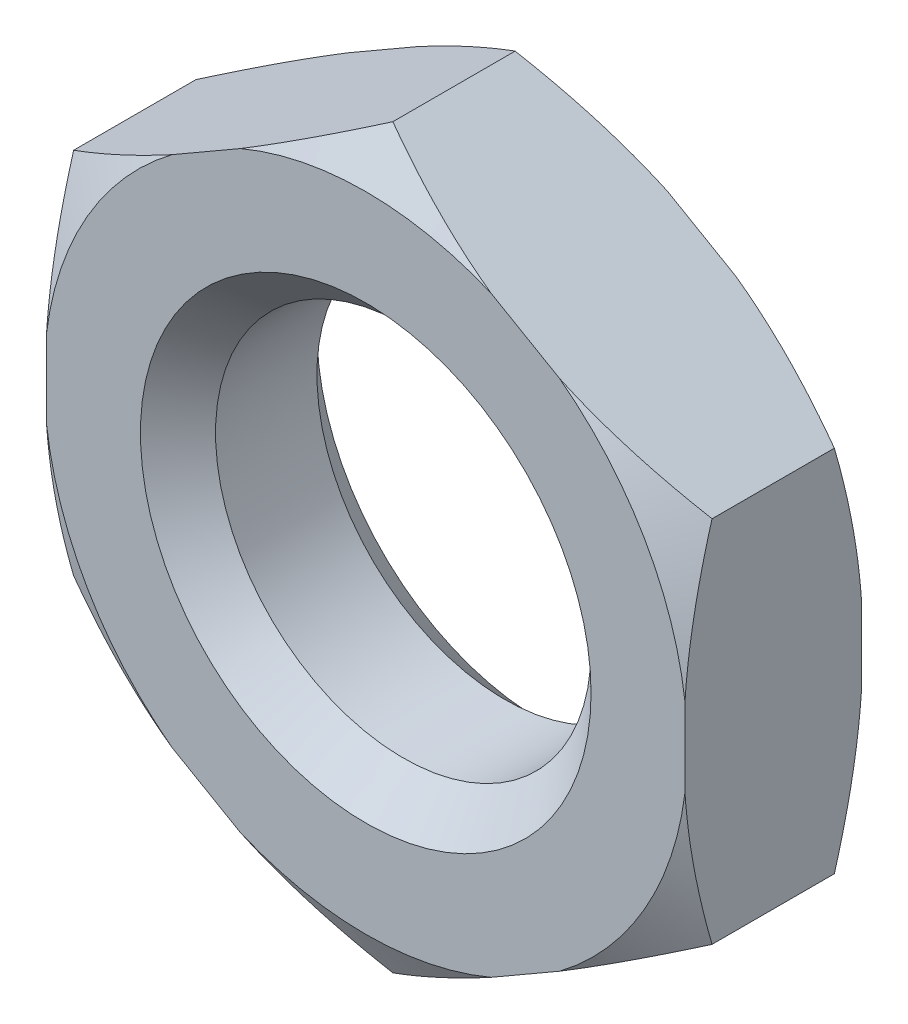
ISO-10303-21;
HEADER;
FILE_DESCRIPTION(('STEP AP214'),'2;1');
FILE_NAME('part.step','',(''),(''),'','','');
FILE_SCHEMA(('AUTOMOTIVE_DESIGN { 1 0 10303 214 1 1 1 1 }'));
ENDSEC;
DATA;
#1=APPLICATION_CONTEXT('core data for automotive mechanical design processes');
#2=APPLICATION_PROTOCOL_DEFINITION('international standard','automotive_design',2000,#1);
#3=PRODUCT_CONTEXT('',#1,'mechanical');
#4=PRODUCT('Part','Part','',(#3));
#5=PRODUCT_RELATED_PRODUCT_CATEGORY('part','',(#4));
#6=PRODUCT_DEFINITION_FORMATION('','',#4);
#7=PRODUCT_DEFINITION_CONTEXT('part definition',#1,'design');
#8=PRODUCT_DEFINITION('design','',#6,#7);
#9=PRODUCT_DEFINITION_SHAPE('','',#8);
#10=(LENGTH_UNIT() NAMED_UNIT(*) SI_UNIT(.MILLI.,.METRE.));
#11=(NAMED_UNIT(*) PLANE_ANGLE_UNIT() SI_UNIT($,.RADIAN.));
#12=(NAMED_UNIT(*) SI_UNIT($,.STERADIAN.) SOLID_ANGLE_UNIT());
#13=UNCERTAINTY_MEASURE_WITH_UNIT(LENGTH_MEASURE(1.E-05),#10,'distance_accuracy_value','');
#14=(GEOMETRIC_REPRESENTATION_CONTEXT(3) GLOBAL_UNCERTAINTY_ASSIGNED_CONTEXT((#13)) GLOBAL_UNIT_ASSIGNED_CONTEXT((#10,
#11,#12)) REPRESENTATION_CONTEXT('',''));
#15=CARTESIAN_POINT('',(0.,0.,0.));
#16=DIRECTION('',(0.,0.,1.));
#17=DIRECTION('',(1.,0.,0.));
#18=AXIS2_PLACEMENT_3D('',#15,#16,#17);
#19=CARTESIAN_POINT('',(8.49999999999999,4.90747728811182,2.35));
#20=DIRECTION('',(-0.5,-0.866025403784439,0.));
#21=DIRECTION('',(0.866025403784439,-0.5,0.));
#22=AXIS2_PLACEMENT_3D('',#19,#20,#21);
#23=PLANE('',#22);
#24=CARTESIAN_POINT('',(-5.90507087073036,13.2242488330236,1.06665217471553));
#25=CARTESIAN_POINT('',(-5.63799011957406,13.0700496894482,0.922520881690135));
#26=CARTESIAN_POINT('',(-5.37027055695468,12.9154817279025,0.779943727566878));
#27=CARTESIAN_POINT('',(-4.83328443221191,12.6054526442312,0.498627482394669));
#28=CARTESIAN_POINT('',(-4.5640176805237,12.4499914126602,0.359888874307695));
#29=CARTESIAN_POINT('',(-4.02286836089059,12.1375587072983,0.0865784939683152));
#30=CARTESIAN_POINT('',(-3.75098017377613,11.9805839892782,-0.0479784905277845));
#31=CARTESIAN_POINT('',(-3.20516765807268,11.6654589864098,-0.311456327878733));
#32=CARTESIAN_POINT('',(-2.93124339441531,11.5073087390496,-0.440377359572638));
#33=CARTESIAN_POINT('',(-2.37402843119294,11.1856005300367,-0.694544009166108));
#34=CARTESIAN_POINT('',(-2.09067683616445,11.0220074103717,-0.819612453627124));
#35=CARTESIAN_POINT('',(-1.52111624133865,10.6931714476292,-1.06084689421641));
#36=CARTESIAN_POINT('',(-1.23490710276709,10.5279285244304,-1.17701245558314));
#37=CARTESIAN_POINT('',(-0.65956429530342,10.1957541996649,-1.39823134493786));
#38=CARTESIAN_POINT('',(-0.370433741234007,10.028824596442,-1.50329536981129));
#39=CARTESIAN_POINT('',(0.211221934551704,9.69300553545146,-1.69988732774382));
#40=CARTESIAN_POINT('',(0.503746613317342,9.52411633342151,-1.79141700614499));
#41=CARTESIAN_POINT('',(1.20327585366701,9.12024293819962,-1.9893958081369));
#42=CARTESIAN_POINT('',(1.61190973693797,8.88431805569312,-2.0884843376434));
#43=CARTESIAN_POINT('',(2.22904112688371,8.52801708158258,-2.20761125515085));
#44=CARTESIAN_POINT('',(2.43543837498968,8.4088535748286,-2.24240162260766));
#45=CARTESIAN_POINT('',(2.84939185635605,8.16985742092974,-2.30127830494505));
#46=CARTESIAN_POINT('',(3.05694807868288,8.05002478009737,-2.32536472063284));
#47=CARTESIAN_POINT('',(3.47040435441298,7.81131568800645,-2.36192589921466));
#48=CARTESIAN_POINT('',(3.67629563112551,7.69244430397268,-2.37453232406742));
#49=CARTESIAN_POINT('',(4.08836628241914,7.45453520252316,-2.38823579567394));
#50=CARTESIAN_POINT('',(4.29454565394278,7.33549748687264,-2.3893329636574));
#51=CARTESIAN_POINT('',(4.7067055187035,7.09753687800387,-2.37998310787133));
#52=CARTESIAN_POINT('',(4.91268601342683,6.97861398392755,-2.36953617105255));
#53=CARTESIAN_POINT('',(5.32401108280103,6.74113534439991,-2.33741437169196));
#54=CARTESIAN_POINT('',(5.52935555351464,6.62257965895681,-2.31573776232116));
#55=CARTESIAN_POINT('',(6.0142832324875,6.34260653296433,-2.25183776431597));
#56=CARTESIAN_POINT('',(6.29341300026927,6.18145088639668,-2.20499080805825));
#57=CARTESIAN_POINT('',(6.8490051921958,5.86067958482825,-2.09361024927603));
#58=CARTESIAN_POINT('',(7.12546722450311,5.70106415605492,-2.02907408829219));
#59=CARTESIAN_POINT('',(7.67568842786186,5.3833937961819,-1.88475105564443));
#60=CARTESIAN_POINT('',(7.9494441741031,5.22534084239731,-1.80494695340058));
#61=CARTESIAN_POINT('',(8.4938845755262,4.91100803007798,-1.63260246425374));
#62=CARTESIAN_POINT('',(8.76456942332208,4.75472806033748,-1.54006288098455));
#63=CARTESIAN_POINT('',(9.30626543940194,4.44197971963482,-1.34327988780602));
#64=CARTESIAN_POINT('',(9.57724186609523,4.28553140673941,-1.23890985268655));
#65=CARTESIAN_POINT('',(10.1163237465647,3.97429233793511,-1.0213923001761));
#66=CARTESIAN_POINT('',(10.3844309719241,3.8195005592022,-0.908250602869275));
#67=CARTESIAN_POINT('',(10.9182012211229,3.51132816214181,-0.67474497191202));
#68=CARTESIAN_POINT('',(11.1838647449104,3.35794725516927,-0.554382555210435));
#69=CARTESIAN_POINT('',(11.7131077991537,3.05238863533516,-0.307698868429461));
#70=CARTESIAN_POINT('',(11.9766872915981,2.90021094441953,-0.18137748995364));
#71=CARTESIAN_POINT('',(12.4223414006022,2.64291242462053,0.0371216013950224));
#72=CARTESIAN_POINT('',(12.6048840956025,2.53752135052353,0.128031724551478));
#73=CARTESIAN_POINT('',(12.9691661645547,2.32720299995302,0.311953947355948));
#74=CARTESIAN_POINT('',(13.1509055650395,2.22227570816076,0.404965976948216));
#75=CARTESIAN_POINT('',(13.5117426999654,2.01394629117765,0.591848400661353));
#76=CARTESIAN_POINT('',(13.6908480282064,1.91053978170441,0.685699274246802));
#77=CARTESIAN_POINT('',(14.0484216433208,1.70409455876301,0.875015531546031));
#78=CARTESIAN_POINT('',(14.2268899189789,1.60105585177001,0.970480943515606));
#79=CARTESIAN_POINT('',(14.4050708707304,1.49818303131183,1.06665217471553));
#80=B_SPLINE_CURVE_WITH_KNOTS('',3,(#24,#25,#26,#27,#28,#29,#30,#31,#32,#33,#34,#35,#36,#37,#38,
#39,#40,#41,#42,#43,#44,#45,#46,#47,#48,#49,#50,#51,#52,#53,#54,#55,#56,#57,#58,#59,#60,#61,#62,
#63,#64,#65,#66,#67,#68,#69,#70,#71,#72,#73,#74,#75,#76,#77,#78,#79),.UNSPECIFIED.,.F.,.F.,(4,2,
2,2,2,2,2,2,2,2,2,2,2,2,2,2,2,2,2,2,2,2,2,2,2,2,2,4),(0.,1.0212601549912,2.04264822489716,
3.06731144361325,4.09194212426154,5.14266283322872,6.19343482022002,7.24318492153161,
8.29279953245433,9.73765676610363,10.4600162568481,11.1823689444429,11.8963287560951,
12.610281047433,13.3242279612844,14.0382859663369,15.0147893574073,15.991434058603,
16.9691875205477,17.9468793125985,18.9362523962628,19.9249745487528,20.9134897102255,
21.902022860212,22.5906653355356,23.2792848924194,23.9606121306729,24.6419513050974),.UNSPECIFIED.);
#81=CARTESIAN_POINT('',(0.,9.81495457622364,-1.62831216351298));
#82=VERTEX_POINT('',#81);
#83=CARTESIAN_POINT('',(3.33822416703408,7.8876299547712,-2.35));
#84=VERTEX_POINT('',#83);
#85=EDGE_CURVE('E169',#82,#84,#80,.T.);
#86=ORIENTED_EDGE('',*,*,#85,.F.);
#87=DIRECTION('',(0.,0.,-1.));
#88=VECTOR('',#87,1.);
#89=CARTESIAN_POINT('',(0.,9.81495457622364,2.35));
#90=LINE('',#89,#88);
#91=CARTESIAN_POINT('',(0.,9.81495457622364,1.62831216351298));
#92=VERTEX_POINT('',#91);
#93=EDGE_CURVE('E206',#92,#82,#90,.T.);
#94=ORIENTED_EDGE('',*,*,#93,.F.);
#95=CARTESIAN_POINT('',(14.4050708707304,1.49818303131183,-1.06665217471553));
#96=CARTESIAN_POINT('',(14.1379901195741,1.65238217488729,-0.922520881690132));
#97=CARTESIAN_POINT('',(13.8702705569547,1.80695013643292,-0.779943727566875));
#98=CARTESIAN_POINT('',(13.3332844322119,2.11697922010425,-0.498627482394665));
#99=CARTESIAN_POINT('',(13.0640176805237,2.27244045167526,-0.359888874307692));
#100=CARTESIAN_POINT('',(12.5228683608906,2.58487315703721,-0.0865784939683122));
#101=CARTESIAN_POINT('',(12.2509801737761,2.74184787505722,0.0479784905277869));
#102=CARTESIAN_POINT('',(11.7051676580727,3.05697287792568,0.311456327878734));
#103=CARTESIAN_POINT('',(11.4312433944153,3.21512312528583,0.44037735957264));
#104=CARTESIAN_POINT('',(10.8740284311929,3.53683133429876,0.69454400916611));
#105=CARTESIAN_POINT('',(10.5906768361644,3.70042445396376,0.819612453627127));
#106=CARTESIAN_POINT('',(10.0211162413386,4.02926041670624,1.06084689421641));
#107=CARTESIAN_POINT('',(9.73490710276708,4.19450333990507,1.17701245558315));
#108=CARTESIAN_POINT('',(9.15956429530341,4.52667766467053,1.39823134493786));
#109=CARTESIAN_POINT('',(8.870433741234,4.69360726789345,1.50329536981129));
#110=CARTESIAN_POINT('',(8.28877806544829,5.029426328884,1.69988732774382));
#111=CARTESIAN_POINT('',(7.99625338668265,5.19831553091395,1.79141700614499));
#112=CARTESIAN_POINT('',(7.29672414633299,5.60218892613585,1.9893958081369));
#113=CARTESIAN_POINT('',(6.88809026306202,5.83811380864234,2.0884843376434));
#114=CARTESIAN_POINT('',(6.27095887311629,6.19441478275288,2.20761125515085));
#115=CARTESIAN_POINT('',(6.06456162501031,6.31357828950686,2.24240162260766));
#116=CARTESIAN_POINT('',(5.65060814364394,6.55257444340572,2.30127830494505));
#117=CARTESIAN_POINT('',(5.44305192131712,6.67240708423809,2.32536472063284));
#118=CARTESIAN_POINT('',(5.02959564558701,6.91111617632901,2.36192589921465));
#119=CARTESIAN_POINT('',(4.82370436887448,7.02998756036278,2.37453232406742));
#120=CARTESIAN_POINT('',(4.41163371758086,7.2678966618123,2.38823579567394));
#121=CARTESIAN_POINT('',(4.20545434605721,7.38693437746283,2.3893329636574));
#122=CARTESIAN_POINT('',(3.79329448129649,7.62489498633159,2.37998310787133));
#123=CARTESIAN_POINT('',(3.58731398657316,7.74381788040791,2.36953617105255));
#124=CARTESIAN_POINT('',(3.17598891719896,7.98129651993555,2.33741437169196));
#125=CARTESIAN_POINT('',(2.97064444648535,8.09985220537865,2.31573776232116));
#126=CARTESIAN_POINT('',(2.4857167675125,8.37982533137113,2.25183776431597));
#127=CARTESIAN_POINT('',(2.20658699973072,8.54098097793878,2.20499080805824));
#128=CARTESIAN_POINT('',(1.65099480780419,8.86175227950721,2.09361024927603));
#129=CARTESIAN_POINT('',(1.37453277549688,9.02136770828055,2.02907408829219));
#130=CARTESIAN_POINT('',(0.824311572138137,9.33903806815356,1.88475105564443));
#131=CARTESIAN_POINT('',(0.550555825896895,9.49709102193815,1.80494695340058));
#132=CARTESIAN_POINT('',(0.00611542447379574,9.81142383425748,1.63260246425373));
#133=CARTESIAN_POINT('',(-0.264569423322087,9.96770380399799,1.54006288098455));
#134=CARTESIAN_POINT('',(-0.806265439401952,10.2804521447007,1.34327988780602));
#135=CARTESIAN_POINT('',(-1.07724186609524,10.4369004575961,1.23890985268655));
#136=CARTESIAN_POINT('',(-1.6163237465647,10.7481395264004,1.02139230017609));
#137=CARTESIAN_POINT('',(-1.88443097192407,10.9029313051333,0.90825060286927));
#138=CARTESIAN_POINT('',(-2.41820122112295,11.2111037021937,0.674744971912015));
#139=CARTESIAN_POINT('',(-2.68386474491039,11.3644846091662,0.55438255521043));
#140=CARTESIAN_POINT('',(-3.21310779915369,11.6700432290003,0.307698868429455));
#141=CARTESIAN_POINT('',(-3.47668729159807,11.8222209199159,0.181377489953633));
#142=CARTESIAN_POINT('',(-3.92234140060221,12.0795194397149,-0.0371216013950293));
#143=CARTESIAN_POINT('',(-4.10488409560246,12.1849105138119,-0.128031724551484));
#144=CARTESIAN_POINT('',(-4.46916616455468,12.3952288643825,-0.311953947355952));
#145=CARTESIAN_POINT('',(-4.65090556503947,12.5001561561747,-0.40496597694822));
#146=CARTESIAN_POINT('',(-5.01174269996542,12.7084855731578,-0.591848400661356));
#147=CARTESIAN_POINT('',(-5.19084802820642,12.8118920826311,-0.685699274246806));
#148=CARTESIAN_POINT('',(-5.5484216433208,13.0183373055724,-0.875015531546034));
#149=CARTESIAN_POINT('',(-5.72688991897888,13.1213760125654,-0.970480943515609));
#150=CARTESIAN_POINT('',(-5.90507087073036,13.2242488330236,-1.06665217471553));
#151=B_SPLINE_CURVE_WITH_KNOTS('',3,(#95,#96,#97,#98,#99,#100,#101,#102,#103,#104,#105,#106,
#107,#108,#109,#110,#111,#112,#113,#114,#115,#116,#117,#118,#119,#120,#121,#122,#123,#124,#125,
#126,#127,#128,#129,#130,#131,#132,#133,#134,#135,#136,#137,#138,#139,#140,#141,#142,#143,#144,
#145,#146,#147,#148,#149,#150),.UNSPECIFIED.,.F.,.F.,(4,2,2,2,2,2,2,2,2,2,2,2,2,2,2,2,2,2,2,2,2,
2,2,2,2,2,2,4),(0.,1.0212601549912,2.04264822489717,3.06731144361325,4.09194212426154,
5.14266283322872,6.19343482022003,7.24318492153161,8.29279953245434,9.73765676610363,
10.4600162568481,11.1823689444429,11.8963287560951,12.610281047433,13.3242279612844,
14.038285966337,15.0147893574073,15.991434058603,16.9691875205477,17.9468793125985,
18.9362523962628,19.9249745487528,20.9134897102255,21.902022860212,22.5906653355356,
23.2792848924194,23.9606121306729,24.6419513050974),.UNSPECIFIED.);
#152=CARTESIAN_POINT('',(3.33822416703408,7.8876299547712,2.35));
#153=VERTEX_POINT('',#152);
#154=EDGE_CURVE('E338',#153,#92,#151,.T.);
#155=ORIENTED_EDGE('',*,*,#154,.F.);
#156=DIRECTION('',(-0.866025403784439,0.5,0.));
#157=VECTOR('',#156,1.);
#158=CARTESIAN_POINT('',(8.49999999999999,4.90747728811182,2.35));
#159=LINE('',#158,#157);
#160=CARTESIAN_POINT('',(5.16177583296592,6.83480190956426,2.35));
#161=VERTEX_POINT('',#160);
#162=EDGE_CURVE('E322',#161,#153,#159,.T.);
#163=ORIENTED_EDGE('',*,*,#162,.F.);
#164=CARTESIAN_POINT('',(8.49999999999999,4.90747728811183,1.62831216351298));
#165=VERTEX_POINT('',#164);
#166=EDGE_CURVE('E185',#165,#161,#151,.T.);
#167=ORIENTED_EDGE('',*,*,#166,.F.);
#168=DIRECTION('',(0.,0.,-1.));
#169=VECTOR('',#168,1.);
#170=CARTESIAN_POINT('',(8.49999999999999,4.90747728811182,2.35));
#171=LINE('',#170,#169);
#172=CARTESIAN_POINT('',(8.49999999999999,4.90747728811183,-1.62831216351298));
#173=VERTEX_POINT('',#172);
#174=EDGE_CURVE('E175',#165,#173,#171,.T.);
#175=ORIENTED_EDGE('',*,*,#174,.T.);
#176=CARTESIAN_POINT('',(5.16177583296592,6.83480190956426,-2.35));
#177=VERTEX_POINT('',#176);
#178=EDGE_CURVE('E157',#177,#173,#80,.T.);
#179=ORIENTED_EDGE('',*,*,#178,.F.);
#180=DIRECTION('',(-0.866025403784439,0.5,0.));
#181=VECTOR('',#180,1.);
#182=CARTESIAN_POINT('',(8.49999999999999,4.90747728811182,-2.35));
#183=LINE('',#182,#181);
#184=EDGE_CURVE('E241',#177,#84,#183,.T.);
#185=ORIENTED_EDGE('',*,*,#184,.T.);
#186=EDGE_LOOP('',(#86,#94,#155,#163,#167,#175,#179,#185));
#187=FACE_BOUND('',#186,.T.);
#188=ADVANCED_FACE('F33',(#187),#23,.F.);
#189=CARTESIAN_POINT('',(0.,9.81495457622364,2.35));
#190=DIRECTION('',(0.5,-0.866025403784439,0.));
#191=DIRECTION('',(0.866025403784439,0.5,0.));
#192=AXIS2_PLACEMENT_3D('',#189,#190,#191);
#193=PLANE('',#192);
#194=CARTESIAN_POINT('',(-14.4050708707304,1.49818303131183,1.06665217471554));
#195=CARTESIAN_POINT('',(-14.1379901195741,1.65238217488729,0.92252088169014));
#196=CARTESIAN_POINT('',(-13.8702705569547,1.80695013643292,0.779943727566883));
#197=CARTESIAN_POINT('',(-13.3332844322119,2.11697922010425,0.498627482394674));
#198=CARTESIAN_POINT('',(-13.0640176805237,2.27244045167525,0.359888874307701));
#199=CARTESIAN_POINT('',(-12.5228683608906,2.58487315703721,0.0865784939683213));
#200=CARTESIAN_POINT('',(-12.2509801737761,2.74184787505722,-0.0479784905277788));
#201=CARTESIAN_POINT('',(-11.7051676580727,3.05697287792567,-0.311456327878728));
#202=CARTESIAN_POINT('',(-11.4312433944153,3.21512312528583,-0.440377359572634));
#203=CARTESIAN_POINT('',(-10.8740284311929,3.53683133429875,-0.694544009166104));
#204=CARTESIAN_POINT('',(-10.5906768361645,3.70042445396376,-0.81961245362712));
#205=CARTESIAN_POINT('',(-10.0211162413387,4.02926041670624,-1.0608468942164));
#206=CARTESIAN_POINT('',(-9.7349071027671,4.19450333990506,-1.17701245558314));
#207=CARTESIAN_POINT('',(-9.15956429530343,4.52667766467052,-1.39823134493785));
#208=CARTESIAN_POINT('',(-8.87043374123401,4.69360726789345,-1.50329536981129));
#209=CARTESIAN_POINT('',(-8.2887780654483,5.029426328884,-1.69988732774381));
#210=CARTESIAN_POINT('',(-7.99625338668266,5.19831553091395,-1.79141700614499));
#211=CARTESIAN_POINT('',(-7.296724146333,5.60218892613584,-1.9893958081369));
#212=CARTESIAN_POINT('',(-6.88809026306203,5.83811380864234,-2.0884843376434));
#213=CARTESIAN_POINT('',(-6.2709588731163,6.19441478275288,-2.20761125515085));
#214=CARTESIAN_POINT('',(-6.06456162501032,6.31357828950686,-2.24240162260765));
#215=CARTESIAN_POINT('',(-5.65060814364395,6.55257444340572,-2.30127830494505));
#216=CARTESIAN_POINT('',(-5.44305192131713,6.67240708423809,-2.32536472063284));
#217=CARTESIAN_POINT('',(-5.02959564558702,6.911116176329,-2.36192589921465));
#218=CARTESIAN_POINT('',(-4.82370436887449,7.02998756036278,-2.37453232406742));
#219=CARTESIAN_POINT('',(-4.41163371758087,7.2678966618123,-2.38823579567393));
#220=CARTESIAN_POINT('',(-4.20545434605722,7.38693437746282,-2.3893329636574));
#221=CARTESIAN_POINT('',(-3.7932944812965,7.62489498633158,-2.37998310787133));
#222=CARTESIAN_POINT('',(-3.58731398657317,7.74381788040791,-2.36953617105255));
#223=CARTESIAN_POINT('',(-3.17598891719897,7.98129651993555,-2.33741437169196));
#224=CARTESIAN_POINT('',(-2.97064444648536,8.09985220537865,-2.31573776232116));
#225=CARTESIAN_POINT('',(-2.48571676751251,8.37982533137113,-2.25183776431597));
#226=CARTESIAN_POINT('',(-2.20658699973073,8.54098097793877,-2.20499080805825));
#227=CARTESIAN_POINT('',(-1.6509948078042,8.86175227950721,-2.09361024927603));
#228=CARTESIAN_POINT('',(-1.37453277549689,9.02136770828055,-2.02907408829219));
#229=CARTESIAN_POINT('',(-0.824311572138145,9.33903806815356,-1.88475105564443));
#230=CARTESIAN_POINT('',(-0.550555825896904,9.49709102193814,-1.80494695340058));
#231=CARTESIAN_POINT('',(-0.00611542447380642,9.81142383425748,-1.63260246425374));
#232=CARTESIAN_POINT('',(0.264569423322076,9.96770380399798,-1.54006288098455));
#233=CARTESIAN_POINT('',(0.80626543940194,10.2804521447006,-1.34327988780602));
#234=CARTESIAN_POINT('',(1.07724186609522,10.436900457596,-1.23890985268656));
#235=CARTESIAN_POINT('',(1.61632374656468,10.7481395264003,-1.0213923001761));
#236=CARTESIAN_POINT('',(1.88443097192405,10.9029313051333,-0.908250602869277));
#237=CARTESIAN_POINT('',(2.41820122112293,11.2111037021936,-0.674744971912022));
#238=CARTESIAN_POINT('',(2.68386474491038,11.3644846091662,-0.554382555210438));
#239=CARTESIAN_POINT('',(3.21310779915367,11.6700432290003,-0.307698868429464));
#240=CARTESIAN_POINT('',(3.47668729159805,11.8222209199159,-0.181377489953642));
#241=CARTESIAN_POINT('',(3.9223414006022,12.0795194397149,0.0371216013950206));
#242=CARTESIAN_POINT('',(4.10488409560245,12.1849105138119,0.128031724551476));
#243=CARTESIAN_POINT('',(4.46916616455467,12.3952288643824,0.311953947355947));
#244=CARTESIAN_POINT('',(4.65090556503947,12.5001561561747,0.404965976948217));
#245=CARTESIAN_POINT('',(5.01174269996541,12.7084855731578,0.591848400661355));
#246=CARTESIAN_POINT('',(5.19084802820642,12.8118920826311,0.685699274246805));
#247=CARTESIAN_POINT('',(5.54842164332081,13.0183373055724,0.875015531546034));
#248=CARTESIAN_POINT('',(5.72688991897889,13.1213760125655,0.97048094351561));
#249=CARTESIAN_POINT('',(5.90507087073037,13.2242488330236,1.06665217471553));
#250=B_SPLINE_CURVE_WITH_KNOTS('',3,(#194,#195,#196,#197,#198,#199,#200,#201,#202,#203,#204,
#205,#206,#207,#208,#209,#210,#211,#212,#213,#214,#215,#216,#217,#218,#219,#220,#221,#222,#223,
#224,#225,#226,#227,#228,#229,#230,#231,#232,#233,#234,#235,#236,#237,#238,#239,#240,#241,#242,
#243,#244,#245,#246,#247,#248,#249),.UNSPECIFIED.,.F.,.F.,(4,2,2,2,2,2,2,2,2,2,2,2,2,2,2,2,2,2,
2,2,2,2,2,2,2,2,2,4),(0.,1.0212601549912,2.04264822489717,3.06731144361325,4.09194212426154,
5.14266283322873,6.19343482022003,7.24318492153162,8.29279953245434,9.73765676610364,
10.4600162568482,11.1823689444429,11.8963287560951,12.610281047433,13.3242279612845,
14.038285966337,15.0147893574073,15.991434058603,16.9691875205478,17.9468793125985,
18.9362523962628,19.9249745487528,20.9134897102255,21.902022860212,22.5906653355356,
23.2792848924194,23.9606121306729,24.6419513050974),.UNSPECIFIED.);
#251=CARTESIAN_POINT('',(-8.5,4.90747728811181,-1.62831216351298));
#252=VERTEX_POINT('',#251);
#253=CARTESIAN_POINT('',(-5.16177583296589,6.83480190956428,-2.35));
#254=VERTEX_POINT('',#253);
#255=EDGE_CURVE('E48',#252,#254,#250,.T.);
#256=ORIENTED_EDGE('',*,*,#255,.F.);
#257=DIRECTION('',(0.,0.,-1.));
#258=VECTOR('',#257,1.);
#259=CARTESIAN_POINT('',(-8.5,4.90747728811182,2.35));
#260=LINE('',#259,#258);
#261=CARTESIAN_POINT('',(-8.5,4.90747728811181,1.62831216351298));
#262=VERTEX_POINT('',#261);
#263=EDGE_CURVE('E203',#262,#252,#260,.T.);
#264=ORIENTED_EDGE('',*,*,#263,.F.);
#265=CARTESIAN_POINT('',(5.90507087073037,13.2242488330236,-1.06665217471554));
#266=CARTESIAN_POINT('',(5.63799011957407,13.0700496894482,-0.922520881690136));
#267=CARTESIAN_POINT('',(5.37027055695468,12.9154817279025,-0.779943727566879));
#268=CARTESIAN_POINT('',(4.83328443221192,12.6054526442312,-0.49862748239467));
#269=CARTESIAN_POINT('',(4.56401768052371,12.4499914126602,-0.359888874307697));
#270=CARTESIAN_POINT('',(4.0228683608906,12.1375587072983,-0.0865784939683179));
#271=CARTESIAN_POINT('',(3.75098017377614,11.9805839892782,0.0479784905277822));
#272=CARTESIAN_POINT('',(3.20516765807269,11.6654589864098,0.311456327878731));
#273=CARTESIAN_POINT('',(2.93124339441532,11.5073087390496,0.440377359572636));
#274=CARTESIAN_POINT('',(2.37402843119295,11.1856005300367,0.694544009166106));
#275=CARTESIAN_POINT('',(2.09067683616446,11.0220074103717,0.819612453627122));
#276=CARTESIAN_POINT('',(1.52111624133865,10.6931714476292,1.06084689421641));
#277=CARTESIAN_POINT('',(1.23490710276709,10.5279285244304,1.17701245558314));
#278=CARTESIAN_POINT('',(0.659564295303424,10.1957541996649,1.39823134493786));
#279=CARTESIAN_POINT('',(0.37043374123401,10.028824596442,1.50329536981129));
#280=CARTESIAN_POINT('',(-0.211221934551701,9.69300553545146,1.69988732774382));
#281=CARTESIAN_POINT('',(-0.503746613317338,9.52411633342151,1.79141700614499));
#282=CARTESIAN_POINT('',(-1.203275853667,9.12024293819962,1.9893958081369));
#283=CARTESIAN_POINT('',(-1.61190973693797,8.88431805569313,2.0884843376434));
#284=CARTESIAN_POINT('',(-2.22904112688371,8.52801708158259,2.20761125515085));
#285=CARTESIAN_POINT('',(-2.43543837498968,8.4088535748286,2.24240162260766));
#286=CARTESIAN_POINT('',(-2.84939185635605,8.16985742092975,2.30127830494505));
#287=CARTESIAN_POINT('',(-3.05694807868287,8.05002478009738,2.32536472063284));
#288=CARTESIAN_POINT('',(-3.47040435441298,7.81131568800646,2.36192589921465));
#289=CARTESIAN_POINT('',(-3.67629563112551,7.69244430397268,2.37453232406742));
#290=CARTESIAN_POINT('',(-4.08836628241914,7.45453520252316,2.38823579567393));
#291=CARTESIAN_POINT('',(-4.29454565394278,7.33549748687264,2.3893329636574));
#292=CARTESIAN_POINT('',(-4.7067055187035,7.09753687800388,2.37998310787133));
#293=CARTESIAN_POINT('',(-4.91268601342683,6.97861398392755,2.36953617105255));
#294=CARTESIAN_POINT('',(-5.32401108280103,6.74113534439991,2.33741437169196));
#295=CARTESIAN_POINT('',(-5.52935555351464,6.62257965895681,2.31573776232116));
#296=CARTESIAN_POINT('',(-6.0142832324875,6.34260653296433,2.25183776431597));
#297=CARTESIAN_POINT('',(-6.29341300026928,6.18145088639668,2.20499080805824));
#298=CARTESIAN_POINT('',(-6.84900519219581,5.86067958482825,2.09361024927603));
#299=CARTESIAN_POINT('',(-7.12546722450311,5.70106415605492,2.02907408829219));
#300=CARTESIAN_POINT('',(-7.67568842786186,5.3833937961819,1.88475105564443));
#301=CARTESIAN_POINT('',(-7.9494441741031,5.22534084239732,1.80494695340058));
#302=CARTESIAN_POINT('',(-8.4938845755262,4.91100803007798,1.63260246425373));
#303=CARTESIAN_POINT('',(-8.76456942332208,4.75472806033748,1.54006288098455));
#304=CARTESIAN_POINT('',(-9.30626543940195,4.44197971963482,1.34327988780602));
#305=CARTESIAN_POINT('',(-9.57724186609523,4.28553140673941,1.23890985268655));
#306=CARTESIAN_POINT('',(-10.1163237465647,3.97429233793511,1.02139230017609));
#307=CARTESIAN_POINT('',(-10.3844309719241,3.8195005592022,0.908250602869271));
#308=CARTESIAN_POINT('',(-10.9182012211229,3.51132816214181,0.674744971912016));
#309=CARTESIAN_POINT('',(-11.1838647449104,3.35794725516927,0.554382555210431));
#310=CARTESIAN_POINT('',(-11.7131077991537,3.05238863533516,0.307698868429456));
#311=CARTESIAN_POINT('',(-11.9766872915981,2.90021094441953,0.181377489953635));
#312=CARTESIAN_POINT('',(-12.4223414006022,2.64291242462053,-0.0371216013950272));
#313=CARTESIAN_POINT('',(-12.6048840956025,2.53752135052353,-0.128031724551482));
#314=CARTESIAN_POINT('',(-12.9691661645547,2.32720299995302,-0.311953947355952));
#315=CARTESIAN_POINT('',(-13.1509055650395,2.22227570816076,-0.404965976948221));
#316=CARTESIAN_POINT('',(-13.5117426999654,2.01394629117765,-0.591848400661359));
#317=CARTESIAN_POINT('',(-13.6908480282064,1.91053978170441,-0.685699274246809));
#318=CARTESIAN_POINT('',(-14.0484216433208,1.70409455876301,-0.875015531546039));
#319=CARTESIAN_POINT('',(-14.2268899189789,1.60105585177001,-0.970480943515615));
#320=CARTESIAN_POINT('',(-14.4050708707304,1.49818303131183,-1.06665217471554));
#321=B_SPLINE_CURVE_WITH_KNOTS('',3,(#265,#266,#267,#268,#269,#270,#271,#272,#273,#274,#275,
#276,#277,#278,#279,#280,#281,#282,#283,#284,#285,#286,#287,#288,#289,#290,#291,#292,#293,#294,
#295,#296,#297,#298,#299,#300,#301,#302,#303,#304,#305,#306,#307,#308,#309,#310,#311,#312,#313,
#314,#315,#316,#317,#318,#319,#320),.UNSPECIFIED.,.F.,.F.,(4,2,2,2,2,2,2,2,2,2,2,2,2,2,2,2,2,2,
2,2,2,2,2,2,2,2,2,4),(0.,1.0212601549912,2.04264822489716,3.06731144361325,4.09194212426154,
5.14266283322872,6.19343482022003,7.24318492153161,8.29279953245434,9.73765676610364,
10.4600162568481,11.1823689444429,11.8963287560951,12.610281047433,13.3242279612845,
14.038285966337,15.0147893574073,15.991434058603,16.9691875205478,17.9468793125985,
18.9362523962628,19.9249745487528,20.9134897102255,21.902022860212,22.5906653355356,
23.2792848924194,23.9606121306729,24.6419513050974),.UNSPECIFIED.);
#322=CARTESIAN_POINT('',(-5.16177583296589,6.83480190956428,2.35));
#323=VERTEX_POINT('',#322);
#324=EDGE_CURVE('E316',#323,#262,#321,.T.);
#325=ORIENTED_EDGE('',*,*,#324,.F.);
#326=DIRECTION('',(-0.866025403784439,-0.5,0.));
#327=VECTOR('',#326,1.);
#328=CARTESIAN_POINT('',(0.,9.81495457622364,2.35));
#329=LINE('',#328,#327);
#330=CARTESIAN_POINT('',(-3.33822416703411,7.88762995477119,2.35));
#331=VERTEX_POINT('',#330);
#332=EDGE_CURVE('E325',#331,#323,#329,.T.);
#333=ORIENTED_EDGE('',*,*,#332,.F.);
#334=EDGE_CURVE('E321',#92,#331,#321,.T.);
#335=ORIENTED_EDGE('',*,*,#334,.F.);
#336=ORIENTED_EDGE('',*,*,#93,.T.);
#337=CARTESIAN_POINT('',(-3.33822416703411,7.88762995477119,-2.35));
#338=VERTEX_POINT('',#337);
#339=EDGE_CURVE('E582',#338,#82,#250,.T.);
#340=ORIENTED_EDGE('',*,*,#339,.F.);
#341=DIRECTION('',(-0.866025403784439,-0.5,0.));
#342=VECTOR('',#341,1.);
#343=CARTESIAN_POINT('',(0.,9.81495457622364,-2.35));
#344=LINE('',#343,#342);
#345=EDGE_CURVE('E337',#338,#254,#344,.T.);
#346=ORIENTED_EDGE('',*,*,#345,.T.);
#347=EDGE_LOOP('',(#256,#264,#325,#333,#335,#336,#340,#346));
#348=FACE_BOUND('',#347,.T.);
#349=ADVANCED_FACE('F297',(#348),#193,.F.);
#350=CARTESIAN_POINT('',(-8.5,4.90747728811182,2.35));
#351=DIRECTION('',(1.,0.,0.));
#352=DIRECTION('',(0.,0.,-1.));
#353=AXIS2_PLACEMENT_3D('',#350,#351,#352);
#354=PLANE('',#353);
#355=CARTESIAN_POINT('',(-8.5,-10.8125481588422,0.645659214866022));
#356=CARTESIAN_POINT('',(-8.5,-10.5054486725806,0.506306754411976));
#357=CARTESIAN_POINT('',(-8.5,-10.1975094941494,0.368769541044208));
#358=CARTESIAN_POINT('',(-8.5,-9.57959204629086,0.0982063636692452));
#359=CARTESIAN_POINT('',(-8.5,-9.26961341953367,-0.0348187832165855));
#360=CARTESIAN_POINT('',(-8.5,-8.64606936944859,-0.295970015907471));
#361=CARTESIAN_POINT('',(-8.5,-8.33249437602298,-0.424073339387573));
#362=CARTESIAN_POINT('',(-8.5,-7.70269446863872,-0.673574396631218));
#363=CARTESIAN_POINT('',(-8.5,-7.38646967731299,-0.794972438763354));
#364=CARTESIAN_POINT('',(-8.5,-6.75239517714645,-1.02904749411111));
#365=CARTESIAN_POINT('',(-8.5,-6.4345589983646,-1.14176097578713));
#366=CARTESIAN_POINT('',(-8.5,-5.79548991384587,-1.35723454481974));
#367=CARTESIAN_POINT('',(-8.5,-5.47425684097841,-1.45999413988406));
#368=CARTESIAN_POINT('',(-8.5,-4.82856101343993,-1.65320358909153));
#369=CARTESIAN_POINT('',(-8.5,-4.50410327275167,-1.74367007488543));
#370=CARTESIAN_POINT('',(-8.5,-3.85140158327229,-1.90988870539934));
#371=CARTESIAN_POINT('',(-8.5,-3.52315779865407,-1.98564148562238));
#372=CARTESIAN_POINT('',(-8.5,-2.95653291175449,-2.10068600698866));
#373=CARTESIAN_POINT('',(-8.5,-2.7190145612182,-2.1442289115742));
#374=CARTESIAN_POINT('',(-8.5,-2.24238579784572,-2.22132178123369));
#375=CARTESIAN_POINT('',(-8.5,-2.0032756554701,-2.25487340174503));
#376=CARTESIAN_POINT('',(-8.5,-1.52381534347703,-2.31110682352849));
#377=CARTESIAN_POINT('',(-8.5,-1.2834654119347,-2.33379063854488));
#378=CARTESIAN_POINT('',(-8.5,-0.801948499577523,-2.36763913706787));
#379=CARTESIAN_POINT('',(-8.5,-0.560781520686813,-2.378803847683));
#380=CARTESIAN_POINT('',(-8.5,-0.0783124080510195,-2.38926599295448));
#381=CARTESIAN_POINT('',(-8.5,0.162989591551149,-2.38856955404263));
#382=CARTESIAN_POINT('',(-8.5,0.645264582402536,-2.37534660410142));
#383=CARTESIAN_POINT('',(-8.5,0.886237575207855,-2.36282014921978));
#384=CARTESIAN_POINT('',(-8.5,1.36733301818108,-2.32631969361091));
#385=CARTESIAN_POINT('',(-8.5,1.60745537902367,-2.3023445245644));
#386=CARTESIAN_POINT('',(-8.5,2.08637470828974,-2.24363681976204));
#387=CARTESIAN_POINT('',(-8.5,2.32517162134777,-2.20890383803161));
#388=CARTESIAN_POINT('',(-8.5,2.92025772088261,-2.10970931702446));
#389=CARTESIAN_POINT('',(-8.5,3.27552188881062,-2.03906972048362));
#390=CARTESIAN_POINT('',(-8.5,3.98178756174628,-1.87898494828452));
#391=CARTESIAN_POINT('',(-8.5,4.33278809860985,-1.78953558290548));
#392=CARTESIAN_POINT('',(-8.5,5.03122358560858,-1.59499609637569));
#393=CARTESIAN_POINT('',(-8.5,5.37864891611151,-1.48987177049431));
#394=CARTESIAN_POINT('',(-8.5,6.06940187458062,-1.26711124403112));
#395=CARTESIAN_POINT('',(-8.5,6.41272978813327,-1.14947592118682));
#396=CARTESIAN_POINT('',(-8.5,7.09967269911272,-0.902738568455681));
#397=CARTESIAN_POINT('',(-8.5,7.44324570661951,-0.773520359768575));
#398=CARTESIAN_POINT('',(-8.5,8.12717672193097,-0.506816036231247));
#399=CARTESIAN_POINT('',(-8.5,8.46753452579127,-0.369329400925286));
#400=CARTESIAN_POINT('',(-8.5,9.14336614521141,-0.0885863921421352));
#401=CARTESIAN_POINT('',(-8.5,9.47885717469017,0.0546287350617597));
#402=CARTESIAN_POINT('',(-8.5,10.1474074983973,0.346413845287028));
#403=CARTESIAN_POINT('',(-8.5,10.4804673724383,0.494982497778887));
#404=CARTESIAN_POINT('',(-8.5,10.8125481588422,0.645659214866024));
#405=B_SPLINE_CURVE_WITH_KNOTS('',3,(#355,#356,#357,#358,#359,#360,#361,#362,#363,#364,#365,
#366,#367,#368,#369,#370,#371,#372,#373,#374,#375,#376,#377,#378,#379,#380,#381,#382,#383,#384,
#385,#386,#387,#388,#389,#390,#391,#392,#393,#394,#395,#396,#397,#398,#399,#400,#401,#402,#403,
#404),.UNSPECIFIED.,.F.,.F.,(4,2,2,2,2,2,2,2,2,2,2,2,2,2,2,2,2,2,2,2,2,2,2,2,4),(0.,
1.01172864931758,2.02363955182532,3.03977350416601,4.05586068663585,5.06741778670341,
6.07902489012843,7.08924944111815,8.09943034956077,8.82367557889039,9.54780074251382,
10.2717916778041,10.9957809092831,11.7193962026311,12.4430080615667,13.1666937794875,
13.890409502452,14.9764117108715,16.0626560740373,17.1513064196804,18.2398804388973,
19.3409567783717,20.4421024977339,21.5363932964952,22.6304139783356),.UNSPECIFIED.);
#406=CARTESIAN_POINT('',(-8.5,-4.90747728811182,-1.62831216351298));
#407=VERTEX_POINT('',#406);
#408=CARTESIAN_POINT('',(-8.5,-1.0528280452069,-2.35));
#409=VERTEX_POINT('',#408);
#410=EDGE_CURVE('E56',#407,#409,#405,.T.);
#411=ORIENTED_EDGE('',*,*,#410,.F.);
#412=DIRECTION('',(0.,0.,-1.));
#413=VECTOR('',#412,1.);
#414=CARTESIAN_POINT('',(-8.5,-4.90747728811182,2.35));
#415=LINE('',#414,#413);
#416=CARTESIAN_POINT('',(-8.5,-4.90747728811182,1.62831216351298));
#417=VERTEX_POINT('',#416);
#418=EDGE_CURVE('E200',#417,#407,#415,.T.);
#419=ORIENTED_EDGE('',*,*,#418,.F.);
#420=CARTESIAN_POINT('',(-8.5,10.8125481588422,-0.645659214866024));
#421=CARTESIAN_POINT('',(-8.5,10.5054486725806,-0.506306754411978));
#422=CARTESIAN_POINT('',(-8.5,10.1975094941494,-0.36876954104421));
#423=CARTESIAN_POINT('',(-8.5,9.57959204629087,-0.098206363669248));
#424=CARTESIAN_POINT('',(-8.5,9.26961341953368,0.0348187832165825));
#425=CARTESIAN_POINT('',(-8.5,8.6460693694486,0.295970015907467));
#426=CARTESIAN_POINT('',(-8.5,8.33249437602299,0.42407333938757));
#427=CARTESIAN_POINT('',(-8.5,7.70269446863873,0.673574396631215));
#428=CARTESIAN_POINT('',(-8.5,7.386469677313,0.794972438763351));
#429=CARTESIAN_POINT('',(-8.5,6.75239517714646,1.02904749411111));
#430=CARTESIAN_POINT('',(-8.5,6.43455899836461,1.14176097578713));
#431=CARTESIAN_POINT('',(-8.5,5.79548991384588,1.35723454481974));
#432=CARTESIAN_POINT('',(-8.5,5.47425684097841,1.45999413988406));
#433=CARTESIAN_POINT('',(-8.5,4.82856101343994,1.65320358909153));
#434=CARTESIAN_POINT('',(-8.5,4.50410327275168,1.74367007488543));
#435=CARTESIAN_POINT('',(-8.5,3.85140158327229,1.90988870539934));
#436=CARTESIAN_POINT('',(-8.5,3.52315779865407,1.98564148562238));
#437=CARTESIAN_POINT('',(-8.5,2.9565329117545,2.10068600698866));
#438=CARTESIAN_POINT('',(-8.5,2.7190145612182,2.1442289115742));
#439=CARTESIAN_POINT('',(-8.5,2.24238579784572,2.22132178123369));
#440=CARTESIAN_POINT('',(-8.5,2.0032756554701,2.25487340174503));
#441=CARTESIAN_POINT('',(-8.5,1.52381534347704,2.31110682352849));
#442=CARTESIAN_POINT('',(-8.5,1.28346541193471,2.33379063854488));
#443=CARTESIAN_POINT('',(-8.5,0.801948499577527,2.36763913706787));
#444=CARTESIAN_POINT('',(-8.5,0.560781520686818,2.378803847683));
#445=CARTESIAN_POINT('',(-8.5,0.0783124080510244,2.38926599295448));
#446=CARTESIAN_POINT('',(-8.5,-0.162989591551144,2.38856955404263));
#447=CARTESIAN_POINT('',(-8.5,-0.645264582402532,2.37534660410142));
#448=CARTESIAN_POINT('',(-8.5,-0.88623757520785,2.36282014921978));
#449=CARTESIAN_POINT('',(-8.5,-1.36733301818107,2.32631969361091));
#450=CARTESIAN_POINT('',(-8.5,-1.60745537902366,2.3023445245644));
#451=CARTESIAN_POINT('',(-8.5,-2.08637470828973,2.24363681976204));
#452=CARTESIAN_POINT('',(-8.5,-2.32517162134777,2.20890383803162));
#453=CARTESIAN_POINT('',(-8.5,-2.9202577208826,2.10970931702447));
#454=CARTESIAN_POINT('',(-8.5,-3.27552188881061,2.03906972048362));
#455=CARTESIAN_POINT('',(-8.5,-3.98178756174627,1.87898494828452));
#456=CARTESIAN_POINT('',(-8.5,-4.33278809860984,1.78953558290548));
#457=CARTESIAN_POINT('',(-8.5,-5.03122358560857,1.59499609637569));
#458=CARTESIAN_POINT('',(-8.5,-5.37864891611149,1.48987177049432));
#459=CARTESIAN_POINT('',(-8.5,-6.06940187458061,1.26711124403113));
#460=CARTESIAN_POINT('',(-8.5,-6.41272978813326,1.14947592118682));
#461=CARTESIAN_POINT('',(-8.5,-7.09967269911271,0.902738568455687));
#462=CARTESIAN_POINT('',(-8.5,-7.4432457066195,0.77352035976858));
#463=CARTESIAN_POINT('',(-8.5,-8.12717672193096,0.506816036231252));
#464=CARTESIAN_POINT('',(-8.5,-8.46753452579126,0.369329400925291));
#465=CARTESIAN_POINT('',(-8.5,-9.1433661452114,0.0885863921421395));
#466=CARTESIAN_POINT('',(-8.5,-9.47885717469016,-0.0546287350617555));
#467=CARTESIAN_POINT('',(-8.5,-10.1474074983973,-0.346413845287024));
#468=CARTESIAN_POINT('',(-8.5,-10.4804673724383,-0.494982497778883));
#469=CARTESIAN_POINT('',(-8.5,-10.8125481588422,-0.64565921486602));
#470=B_SPLINE_CURVE_WITH_KNOTS('',3,(#420,#421,#422,#423,#424,#425,#426,#427,#428,#429,#430,
#431,#432,#433,#434,#435,#436,#437,#438,#439,#440,#441,#442,#443,#444,#445,#446,#447,#448,#449,
#450,#451,#452,#453,#454,#455,#456,#457,#458,#459,#460,#461,#462,#463,#464,#465,#466,#467,#468,
#469),.UNSPECIFIED.,.F.,.F.,(4,2,2,2,2,2,2,2,2,2,2,2,2,2,2,2,2,2,2,2,2,2,2,2,4),(0.,
1.01172864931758,2.02363955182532,3.039773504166,4.05586068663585,5.0674177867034,
6.07902489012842,7.08924944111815,8.09943034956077,8.8236755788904,9.54780074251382,
10.2717916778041,10.9957809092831,11.7193962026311,12.4430080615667,13.1666937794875,
13.890409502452,14.9764117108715,16.0626560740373,17.1513064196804,18.2398804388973,
19.3409567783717,20.4421024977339,21.5363932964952,22.6304139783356),.UNSPECIFIED.);
#471=CARTESIAN_POINT('',(-8.5,-1.0528280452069,2.35));
#472=VERTEX_POINT('',#471);
#473=EDGE_CURVE('E303',#472,#417,#470,.T.);
#474=ORIENTED_EDGE('',*,*,#473,.F.);
#475=DIRECTION('',(0.,-1.,0.));
#476=VECTOR('',#475,1.);
#477=CARTESIAN_POINT('',(-8.5,4.90747728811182,2.35));
#478=LINE('',#477,#476);
#479=CARTESIAN_POINT('',(-8.5,1.0528280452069,2.35));
#480=VERTEX_POINT('',#479);
#481=EDGE_CURVE('E328',#480,#472,#478,.T.);
#482=ORIENTED_EDGE('',*,*,#481,.F.);
#483=EDGE_CURVE('E309',#262,#480,#470,.T.);
#484=ORIENTED_EDGE('',*,*,#483,.F.);
#485=ORIENTED_EDGE('',*,*,#263,.T.);
#486=CARTESIAN_POINT('',(-8.5,1.0528280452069,-2.35));
#487=VERTEX_POINT('',#486);
#488=EDGE_CURVE('E286',#487,#252,#405,.T.);
#489=ORIENTED_EDGE('',*,*,#488,.F.);
#490=DIRECTION('',(0.,-1.,0.));
#491=VECTOR('',#490,1.);
#492=CARTESIAN_POINT('',(-8.5,4.90747728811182,-2.35));
#493=LINE('',#492,#491);
#494=EDGE_CURVE('E341',#487,#409,#493,.T.);
#495=ORIENTED_EDGE('',*,*,#494,.T.);
#496=EDGE_LOOP('',(#411,#419,#474,#482,#484,#485,#489,#495));
#497=FACE_BOUND('',#496,.T.);
#498=ADVANCED_FACE('F293',(#497),#354,.F.);
#499=CARTESIAN_POINT('',(-8.5,-4.90747728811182,2.35));
#500=DIRECTION('',(0.5,0.866025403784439,0.));
#501=DIRECTION('',(-0.866025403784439,0.5,0.));
#502=AXIS2_PLACEMENT_3D('',#499,#500,#501);
#503=PLANE('',#502);
#504=CARTESIAN_POINT('',(5.90507087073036,-13.2242488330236,1.06665217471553));
#505=CARTESIAN_POINT('',(5.63799011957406,-13.0700496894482,0.922520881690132));
#506=CARTESIAN_POINT('',(5.37027055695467,-12.9154817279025,0.779943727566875));
#507=CARTESIAN_POINT('',(4.83328443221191,-12.6054526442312,0.498627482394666));
#508=CARTESIAN_POINT('',(4.56401768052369,-12.4499914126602,0.359888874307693));
#509=CARTESIAN_POINT('',(4.02286836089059,-12.1375587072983,0.0865784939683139));
#510=CARTESIAN_POINT('',(3.75098017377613,-11.9805839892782,-0.0479784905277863));
#511=CARTESIAN_POINT('',(3.20516765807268,-11.6654589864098,-0.311456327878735));
#512=CARTESIAN_POINT('',(2.93124339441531,-11.5073087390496,-0.440377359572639));
#513=CARTESIAN_POINT('',(2.37402843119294,-11.1856005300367,-0.694544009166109));
#514=CARTESIAN_POINT('',(2.09067683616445,-11.0220074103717,-0.819612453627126));
#515=CARTESIAN_POINT('',(1.52111624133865,-10.6931714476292,-1.06084689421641));
#516=CARTESIAN_POINT('',(1.23490710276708,-10.5279285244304,-1.17701245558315));
#517=CARTESIAN_POINT('',(0.659564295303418,-10.1957541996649,-1.39823134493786));
#518=CARTESIAN_POINT('',(0.370433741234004,-10.028824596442,-1.50329536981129));
#519=CARTESIAN_POINT('',(-0.211221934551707,-9.69300553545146,-1.69988732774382));
#520=CARTESIAN_POINT('',(-0.503746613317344,-9.52411633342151,-1.79141700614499));
#521=CARTESIAN_POINT('',(-1.20327585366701,-9.12024293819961,-1.9893958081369));
#522=CARTESIAN_POINT('',(-1.61190973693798,-8.88431805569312,-2.0884843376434));
#523=CARTESIAN_POINT('',(-2.22904112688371,-8.52801708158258,-2.20761125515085));
#524=CARTESIAN_POINT('',(-2.43543837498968,-8.4088535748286,-2.24240162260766));
#525=CARTESIAN_POINT('',(-2.84939185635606,-8.16985742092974,-2.30127830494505));
#526=CARTESIAN_POINT('',(-3.05694807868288,-8.05002478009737,-2.32536472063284));
#527=CARTESIAN_POINT('',(-3.47040435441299,-7.81131568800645,-2.36192589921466));
#528=CARTESIAN_POINT('',(-3.67629563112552,-7.69244430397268,-2.37453232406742));
#529=CARTESIAN_POINT('',(-4.08836628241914,-7.45453520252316,-2.38823579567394));
#530=CARTESIAN_POINT('',(-4.29454565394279,-7.33549748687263,-2.3893329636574));
#531=CARTESIAN_POINT('',(-4.70670551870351,-7.09753687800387,-2.37998310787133));
#532=CARTESIAN_POINT('',(-4.91268601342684,-6.97861398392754,-2.36953617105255));
#533=CARTESIAN_POINT('',(-5.32401108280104,-6.74113534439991,-2.33741437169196));
#534=CARTESIAN_POINT('',(-5.52935555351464,-6.62257965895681,-2.31573776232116));
#535=CARTESIAN_POINT('',(-6.0142832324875,-6.34260653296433,-2.25183776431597));
#536=CARTESIAN_POINT('',(-6.29341300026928,-6.18145088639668,-2.20499080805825));
#537=CARTESIAN_POINT('',(-6.84900519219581,-5.86067958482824,-2.09361024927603));
#538=CARTESIAN_POINT('',(-7.12546722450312,-5.70106415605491,-2.02907408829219));
#539=CARTESIAN_POINT('',(-7.67568842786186,-5.3833937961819,-1.88475105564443));
#540=CARTESIAN_POINT('',(-7.9494441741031,-5.22534084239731,-1.80494695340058));
#541=CARTESIAN_POINT('',(-8.4938845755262,-4.91100803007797,-1.63260246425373));
#542=CARTESIAN_POINT('',(-8.76456942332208,-4.75472806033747,-1.54006288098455));
#543=CARTESIAN_POINT('',(-9.30626543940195,-4.44197971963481,-1.34327988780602));
#544=CARTESIAN_POINT('',(-9.57724186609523,-4.2855314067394,-1.23890985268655));
#545=CARTESIAN_POINT('',(-10.1163237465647,-3.97429233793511,-1.0213923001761));
#546=CARTESIAN_POINT('',(-10.3844309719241,-3.81950055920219,-0.908250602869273));
#547=CARTESIAN_POINT('',(-10.9182012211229,-3.5113281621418,-0.674744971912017));
#548=CARTESIAN_POINT('',(-11.1838647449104,-3.35794725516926,-0.554382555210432));
#549=CARTESIAN_POINT('',(-11.7131077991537,-3.05238863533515,-0.307698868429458));
#550=CARTESIAN_POINT('',(-11.9766872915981,-2.90021094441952,-0.181377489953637));
#551=CARTESIAN_POINT('',(-12.4223414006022,-2.64291242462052,0.0371216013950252));
#552=CARTESIAN_POINT('',(-12.6048840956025,-2.53752135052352,0.12803172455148));
#553=CARTESIAN_POINT('',(-12.9691661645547,-2.32720299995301,0.311953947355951));
#554=CARTESIAN_POINT('',(-13.1509055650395,-2.22227570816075,0.40496597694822));
#555=CARTESIAN_POINT('',(-13.5117426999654,-2.01394629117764,0.591848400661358));
#556=CARTESIAN_POINT('',(-13.6908480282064,-1.9105397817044,0.685699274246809));
#557=CARTESIAN_POINT('',(-14.0484216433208,-1.704094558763,0.875015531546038));
#558=CARTESIAN_POINT('',(-14.2268899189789,-1.60105585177,0.970480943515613));
#559=CARTESIAN_POINT('',(-14.4050708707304,-1.49818303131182,1.06665217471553));
#560=B_SPLINE_CURVE_WITH_KNOTS('',3,(#504,#505,#506,#507,#508,#509,#510,#511,#512,#513,#514,
#515,#516,#517,#518,#519,#520,#521,#522,#523,#524,#525,#526,#527,#528,#529,#530,#531,#532,#533,
#534,#535,#536,#537,#538,#539,#540,#541,#542,#543,#544,#545,#546,#547,#548,#549,#550,#551,#552,
#553,#554,#555,#556,#557,#558,#559),.UNSPECIFIED.,.F.,.F.,(4,2,2,2,2,2,2,2,2,2,2,2,2,2,2,2,2,2,
2,2,2,2,2,2,2,2,2,4),(0.,1.0212601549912,2.04264822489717,3.06731144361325,4.09194212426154,
5.14266283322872,6.19343482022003,7.24318492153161,8.29279953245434,9.73765676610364,
10.4600162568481,11.1823689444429,11.8963287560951,12.610281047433,13.3242279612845,
14.038285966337,15.0147893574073,15.991434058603,16.9691875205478,17.9468793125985,
18.9362523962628,19.9249745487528,20.9134897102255,21.902022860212,22.5906653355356,
23.2792848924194,23.9606121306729,24.6419513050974),.UNSPECIFIED.);
#561=CARTESIAN_POINT('',(0.,-9.81495457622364,-1.62831216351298));
#562=VERTEX_POINT('',#561);
#563=CARTESIAN_POINT('',(-3.33822416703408,-7.88762995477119,-2.35));
#564=VERTEX_POINT('',#563);
#565=EDGE_CURVE('E276',#562,#564,#560,.T.);
#566=ORIENTED_EDGE('',*,*,#565,.F.);
#567=DIRECTION('',(0.,0.,-1.));
#568=VECTOR('',#567,1.);
#569=CARTESIAN_POINT('',(0.,-9.81495457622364,2.35));
#570=LINE('',#569,#568);
#571=CARTESIAN_POINT('',(0.,-9.81495457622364,1.62831216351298));
#572=VERTEX_POINT('',#571);
#573=EDGE_CURVE('E190',#572,#562,#570,.T.);
#574=ORIENTED_EDGE('',*,*,#573,.F.);
#575=CARTESIAN_POINT('',(-14.4050708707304,-1.49818303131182,-1.06665217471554));
#576=CARTESIAN_POINT('',(-14.1379901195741,-1.65238217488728,-0.922520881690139));
#577=CARTESIAN_POINT('',(-13.8702705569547,-1.80695013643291,-0.779943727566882));
#578=CARTESIAN_POINT('',(-13.3332844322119,-2.11697922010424,-0.498627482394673));
#579=CARTESIAN_POINT('',(-13.0640176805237,-2.27244045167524,-0.359888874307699));
#580=CARTESIAN_POINT('',(-12.5228683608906,-2.5848731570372,-0.0865784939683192));
#581=CARTESIAN_POINT('',(-12.2509801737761,-2.74184787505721,0.0479784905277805));
#582=CARTESIAN_POINT('',(-11.7051676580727,-3.05697287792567,0.311456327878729));
#583=CARTESIAN_POINT('',(-11.4312433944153,-3.21512312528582,0.440377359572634));
#584=CARTESIAN_POINT('',(-10.874028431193,-3.53683133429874,0.694544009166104));
#585=CARTESIAN_POINT('',(-10.5906768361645,-3.70042445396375,0.819612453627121));
#586=CARTESIAN_POINT('',(-10.0211162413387,-4.02926041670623,1.0608468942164));
#587=CARTESIAN_POINT('',(-9.7349071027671,-4.19450333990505,1.17701245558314));
#588=CARTESIAN_POINT('',(-9.15956429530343,-4.52667766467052,1.39823134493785));
#589=CARTESIAN_POINT('',(-8.87043374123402,-4.69360726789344,1.50329536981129));
#590=CARTESIAN_POINT('',(-8.28877806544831,-5.02942632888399,1.69988732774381));
#591=CARTESIAN_POINT('',(-7.99625338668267,-5.19831553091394,1.79141700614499));
#592=CARTESIAN_POINT('',(-7.296724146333,-5.60218892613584,1.98939580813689));
#593=CARTESIAN_POINT('',(-6.88809026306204,-5.83811380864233,2.0884843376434));
#594=CARTESIAN_POINT('',(-6.2709588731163,-6.19441478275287,2.20761125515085));
#595=CARTESIAN_POINT('',(-6.06456162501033,-6.31357828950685,2.24240162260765));
#596=CARTESIAN_POINT('',(-5.65060814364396,-6.55257444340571,2.30127830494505));
#597=CARTESIAN_POINT('',(-5.44305192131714,-6.67240708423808,2.32536472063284));
#598=CARTESIAN_POINT('',(-5.02959564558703,-6.911116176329,2.36192589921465));
#599=CARTESIAN_POINT('',(-4.8237043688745,-7.02998756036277,2.37453232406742));
#600=CARTESIAN_POINT('',(-4.41163371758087,-7.26789666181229,2.38823579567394));
#601=CARTESIAN_POINT('',(-4.20545434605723,-7.38693437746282,2.3893329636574));
#602=CARTESIAN_POINT('',(-3.79329448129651,-7.62489498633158,2.37998310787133));
#603=CARTESIAN_POINT('',(-3.58731398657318,-7.7438178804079,2.36953617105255));
#604=CARTESIAN_POINT('',(-3.17598891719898,-7.98129651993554,2.33741437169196));
#605=CARTESIAN_POINT('',(-2.97064444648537,-8.09985220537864,2.31573776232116));
#606=CARTESIAN_POINT('',(-2.48571676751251,-8.37982533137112,2.25183776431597));
#607=CARTESIAN_POINT('',(-2.20658699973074,-8.54098097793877,2.20499080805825));
#608=CARTESIAN_POINT('',(-1.6509948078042,-8.86175227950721,2.09361024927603));
#609=CARTESIAN_POINT('',(-1.3745327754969,-9.02136770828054,2.0290740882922));
#610=CARTESIAN_POINT('',(-0.824311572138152,-9.33903806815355,1.88475105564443));
#611=CARTESIAN_POINT('',(-0.550555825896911,-9.49709102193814,1.80494695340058));
#612=CARTESIAN_POINT('',(-0.00611542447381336,-9.81142383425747,1.63260246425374));
#613=CARTESIAN_POINT('',(0.264569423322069,-9.96770380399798,1.54006288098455));
#614=CARTESIAN_POINT('',(0.806265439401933,-10.2804521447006,1.34327988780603));
#615=CARTESIAN_POINT('',(1.07724186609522,-10.436900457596,1.23890985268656));
#616=CARTESIAN_POINT('',(1.61632374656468,-10.7481395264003,1.0213923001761));
#617=CARTESIAN_POINT('',(1.88443097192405,-10.9029313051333,0.908250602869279));
#618=CARTESIAN_POINT('',(2.41820122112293,-11.2111037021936,0.674744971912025));
#619=CARTESIAN_POINT('',(2.68386474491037,-11.3644846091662,0.554382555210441));
#620=CARTESIAN_POINT('',(3.21310779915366,-11.6700432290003,0.307698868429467));
#621=CARTESIAN_POINT('',(3.47668729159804,-11.8222209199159,0.181377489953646));
#622=CARTESIAN_POINT('',(3.92234140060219,-12.0795194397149,-0.0371216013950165));
#623=CARTESIAN_POINT('',(4.10488409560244,-12.1849105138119,-0.128031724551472));
#624=CARTESIAN_POINT('',(4.46916616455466,-12.3952288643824,-0.311953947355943));
#625=CARTESIAN_POINT('',(4.65090556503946,-12.5001561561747,-0.404965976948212));
#626=CARTESIAN_POINT('',(5.0117426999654,-12.7084855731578,-0.59184840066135));
#627=CARTESIAN_POINT('',(5.19084802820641,-12.8118920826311,-0.685699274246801));
#628=CARTESIAN_POINT('',(5.5484216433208,-13.0183373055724,-0.875015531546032));
#629=CARTESIAN_POINT('',(5.72688991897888,-13.1213760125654,-0.970480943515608));
#630=CARTESIAN_POINT('',(5.90507087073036,-13.2242488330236,-1.06665217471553));
#631=B_SPLINE_CURVE_WITH_KNOTS('',3,(#575,#576,#577,#578,#579,#580,#581,#582,#583,#584,#585,
#586,#587,#588,#589,#590,#591,#592,#593,#594,#595,#596,#597,#598,#599,#600,#601,#602,#603,#604,
#605,#606,#607,#608,#609,#610,#611,#612,#613,#614,#615,#616,#617,#618,#619,#620,#621,#622,#623,
#624,#625,#626,#627,#628,#629,#630),.UNSPECIFIED.,.F.,.F.,(4,2,2,2,2,2,2,2,2,2,2,2,2,2,2,2,2,2,
2,2,2,2,2,2,2,2,2,4),(0.,1.0212601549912,2.04264822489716,3.06731144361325,4.09194212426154,
5.14266283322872,6.19343482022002,7.24318492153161,8.29279953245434,9.73765676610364,
10.4600162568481,11.1823689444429,11.8963287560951,12.610281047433,13.3242279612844,
14.038285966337,15.0147893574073,15.991434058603,16.9691875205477,17.9468793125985,
18.9362523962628,19.9249745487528,20.9134897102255,21.902022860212,22.5906653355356,
23.2792848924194,23.9606121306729,24.6419513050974),.UNSPECIFIED.);
#632=CARTESIAN_POINT('',(-3.33822416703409,-7.8876299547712,2.35));
#633=VERTEX_POINT('',#632);
#634=EDGE_CURVE('E311',#633,#572,#631,.T.);
#635=ORIENTED_EDGE('',*,*,#634,.F.);
#636=DIRECTION('',(0.866025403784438,-0.5,0.));
#637=VECTOR('',#636,1.);
#638=CARTESIAN_POINT('',(-8.5,-4.90747728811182,2.35));
#639=LINE('',#638,#637);
#640=CARTESIAN_POINT('',(-5.16177583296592,-6.83480190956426,2.35));
#641=VERTEX_POINT('',#640);
#642=EDGE_CURVE('E331',#641,#633,#639,.T.);
#643=ORIENTED_EDGE('',*,*,#642,.F.);
#644=EDGE_CURVE('E310',#417,#641,#631,.T.);
#645=ORIENTED_EDGE('',*,*,#644,.F.);
#646=ORIENTED_EDGE('',*,*,#418,.T.);
#647=CARTESIAN_POINT('',(-5.16177583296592,-6.83480190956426,-2.35));
#648=VERTEX_POINT('',#647);
#649=EDGE_CURVE('E287',#648,#407,#560,.T.);
#650=ORIENTED_EDGE('',*,*,#649,.F.);
#651=DIRECTION('',(0.866025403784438,-0.5,0.));
#652=VECTOR('',#651,1.);
#653=CARTESIAN_POINT('',(-8.5,-4.90747728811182,-2.35));
#654=LINE('',#653,#652);
#655=EDGE_CURVE('E344',#648,#564,#654,.T.);
#656=ORIENTED_EDGE('',*,*,#655,.T.);
#657=EDGE_LOOP('',(#566,#574,#635,#643,#645,#646,#650,#656));
#658=FACE_BOUND('',#657,.T.);
#659=ADVANCED_FACE('F296',(#658),#503,.F.);
#660=CARTESIAN_POINT('',(0.,-9.81495457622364,2.35));
#661=DIRECTION('',(-0.5,0.866025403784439,0.));
#662=DIRECTION('',(-0.866025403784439,-0.5,0.));
#663=AXIS2_PLACEMENT_3D('',#660,#661,#662);
#664=PLANE('',#663);
#665=CARTESIAN_POINT('',(14.4050708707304,-1.49818303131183,1.06665217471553));
#666=CARTESIAN_POINT('',(14.1379901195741,-1.65238217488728,0.922520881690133));
#667=CARTESIAN_POINT('',(13.8702705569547,-1.80695013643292,0.779943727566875));
#668=CARTESIAN_POINT('',(13.3332844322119,-2.11697922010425,0.498627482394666));
#669=CARTESIAN_POINT('',(13.0640176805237,-2.27244045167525,0.359888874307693));
#670=CARTESIAN_POINT('',(12.5228683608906,-2.58487315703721,0.0865784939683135));
#671=CARTESIAN_POINT('',(12.2509801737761,-2.74184787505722,-0.0479784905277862));
#672=CARTESIAN_POINT('',(11.7051676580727,-3.05697287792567,-0.311456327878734));
#673=CARTESIAN_POINT('',(11.4312433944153,-3.21512312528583,-0.440377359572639));
#674=CARTESIAN_POINT('',(10.8740284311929,-3.53683133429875,-0.69454400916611));
#675=CARTESIAN_POINT('',(10.5906768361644,-3.70042445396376,-0.819612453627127));
#676=CARTESIAN_POINT('',(10.0211162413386,-4.02926041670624,-1.06084689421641));
#677=CARTESIAN_POINT('',(9.73490710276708,-4.19450333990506,-1.17701245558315));
#678=CARTESIAN_POINT('',(9.15956429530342,-4.52667766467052,-1.39823134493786));
#679=CARTESIAN_POINT('',(8.870433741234,-4.69360726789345,-1.50329536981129));
#680=CARTESIAN_POINT('',(8.28877806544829,-5.029426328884,-1.69988732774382));
#681=CARTESIAN_POINT('',(7.99625338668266,-5.19831553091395,-1.79141700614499));
#682=CARTESIAN_POINT('',(7.29672414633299,-5.60218892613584,-1.9893958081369));
#683=CARTESIAN_POINT('',(6.88809026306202,-5.83811380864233,-2.08848433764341));
#684=CARTESIAN_POINT('',(6.27095887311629,-6.19441478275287,-2.20761125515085));
#685=CARTESIAN_POINT('',(6.06456162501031,-6.31357828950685,-2.24240162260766));
#686=CARTESIAN_POINT('',(5.65060814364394,-6.55257444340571,-2.30127830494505));
#687=CARTESIAN_POINT('',(5.44305192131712,-6.67240708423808,-2.32536472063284));
#688=CARTESIAN_POINT('',(5.02959564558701,-6.911116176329,-2.36192589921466));
#689=CARTESIAN_POINT('',(4.82370436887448,-7.02998756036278,-2.37453232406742));
#690=CARTESIAN_POINT('',(4.41163371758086,-7.2678966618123,-2.38823579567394));
#691=CARTESIAN_POINT('',(4.20545434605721,-7.38693437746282,-2.3893329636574));
#692=CARTESIAN_POINT('',(3.79329448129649,-7.62489498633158,-2.37998310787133));
#693=CARTESIAN_POINT('',(3.58731398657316,-7.74381788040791,-2.36953617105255));
#694=CARTESIAN_POINT('',(3.17598891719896,-7.98129651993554,-2.33741437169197));
#695=CARTESIAN_POINT('',(2.97064444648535,-8.09985220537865,-2.31573776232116));
#696=CARTESIAN_POINT('',(2.4857167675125,-8.37982533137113,-2.25183776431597));
#697=CARTESIAN_POINT('',(2.20658699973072,-8.54098097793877,-2.20499080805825));
#698=CARTESIAN_POINT('',(1.65099480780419,-8.86175227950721,-2.09361024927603));
#699=CARTESIAN_POINT('',(1.37453277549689,-9.02136770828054,-2.0290740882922));
#700=CARTESIAN_POINT('',(0.824311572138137,-9.33903806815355,-1.88475105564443));
#701=CARTESIAN_POINT('',(0.550555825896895,-9.49709102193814,-1.80494695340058));
#702=CARTESIAN_POINT('',(0.00611542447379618,-9.81142383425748,-1.63260246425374));
#703=CARTESIAN_POINT('',(-0.264569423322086,-9.96770380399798,-1.54006288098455));
#704=CARTESIAN_POINT('',(-0.806265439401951,-10.2804521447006,-1.34327988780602));
#705=CARTESIAN_POINT('',(-1.07724186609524,-10.436900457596,-1.23890985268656));
#706=CARTESIAN_POINT('',(-1.6163237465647,-10.7481395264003,-1.0213923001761));
#707=CARTESIAN_POINT('',(-1.88443097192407,-10.9029313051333,-0.908250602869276));
#708=CARTESIAN_POINT('',(-2.41820122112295,-11.2111037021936,-0.67474497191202));
#709=CARTESIAN_POINT('',(-2.68386474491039,-11.3644846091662,-0.554382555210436));
#710=CARTESIAN_POINT('',(-3.21310779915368,-11.6700432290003,-0.307698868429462));
#711=CARTESIAN_POINT('',(-3.47668729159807,-11.8222209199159,-0.18137748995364));
#712=CARTESIAN_POINT('',(-3.92234140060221,-12.0795194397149,0.0371216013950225));
#713=CARTESIAN_POINT('',(-4.10488409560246,-12.1849105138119,0.128031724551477));
#714=CARTESIAN_POINT('',(-4.46916616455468,-12.3952288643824,0.311953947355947));
#715=CARTESIAN_POINT('',(-4.65090556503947,-12.5001561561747,0.404965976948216));
#716=CARTESIAN_POINT('',(-5.01174269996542,-12.7084855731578,0.591848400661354));
#717=CARTESIAN_POINT('',(-5.19084802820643,-12.811892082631,0.685699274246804));
#718=CARTESIAN_POINT('',(-5.54842164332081,-13.0183373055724,0.875015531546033));
#719=CARTESIAN_POINT('',(-5.72688991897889,-13.1213760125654,0.970480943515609));
#720=CARTESIAN_POINT('',(-5.90507087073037,-13.2242488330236,1.06665217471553));
#721=B_SPLINE_CURVE_WITH_KNOTS('',3,(#665,#666,#667,#668,#669,#670,#671,#672,#673,#674,#675,
#676,#677,#678,#679,#680,#681,#682,#683,#684,#685,#686,#687,#688,#689,#690,#691,#692,#693,#694,
#695,#696,#697,#698,#699,#700,#701,#702,#703,#704,#705,#706,#707,#708,#709,#710,#711,#712,#713,
#714,#715,#716,#717,#718,#719,#720),.UNSPECIFIED.,.F.,.F.,(4,2,2,2,2,2,2,2,2,2,2,2,2,2,2,2,2,2,
2,2,2,2,2,2,2,2,2,4),(0.,1.0212601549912,2.04264822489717,3.06731144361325,4.09194212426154,
5.14266283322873,6.19343482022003,7.24318492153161,8.29279953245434,9.73765676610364,
10.4600162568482,11.1823689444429,11.8963287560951,12.610281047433,13.3242279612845,
14.038285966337,15.0147893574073,15.991434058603,16.9691875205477,17.9468793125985,
18.9362523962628,19.9249745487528,20.9134897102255,21.902022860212,22.5906653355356,
23.2792848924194,23.9606121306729,24.6419513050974),.UNSPECIFIED.);
#722=CARTESIAN_POINT('',(8.49999999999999,-4.90747728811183,-1.62831216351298));
#723=VERTEX_POINT('',#722);
#724=CARTESIAN_POINT('',(5.16177583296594,-6.83480190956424,-2.35));
#725=VERTEX_POINT('',#724);
#726=EDGE_CURVE('E179',#723,#725,#721,.T.);
#727=ORIENTED_EDGE('',*,*,#726,.F.);
#728=DIRECTION('',(0.,0.,-1.));
#729=VECTOR('',#728,1.);
#730=CARTESIAN_POINT('',(8.49999999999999,-4.90747728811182,2.35));
#731=LINE('',#730,#729);
#732=CARTESIAN_POINT('',(8.49999999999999,-4.90747728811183,1.62831216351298));
#733=VERTEX_POINT('',#732);
#734=EDGE_CURVE('E186',#733,#723,#731,.T.);
#735=ORIENTED_EDGE('',*,*,#734,.F.);
#736=CARTESIAN_POINT('',(-5.90507087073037,-13.2242488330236,-1.06665217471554));
#737=CARTESIAN_POINT('',(-5.63799011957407,-13.0700496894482,-0.922520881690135));
#738=CARTESIAN_POINT('',(-5.37027055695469,-12.9154817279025,-0.779943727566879));
#739=CARTESIAN_POINT('',(-4.83328443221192,-12.6054526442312,-0.49862748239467));
#740=CARTESIAN_POINT('',(-4.56401768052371,-12.4499914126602,-0.359888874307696));
#741=CARTESIAN_POINT('',(-4.02286836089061,-12.1375587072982,-0.0865784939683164));
#742=CARTESIAN_POINT('',(-3.75098017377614,-11.9805839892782,0.0479784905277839));
#743=CARTESIAN_POINT('',(-3.20516765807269,-11.6654589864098,0.311456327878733));
#744=CARTESIAN_POINT('',(-2.93124339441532,-11.5073087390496,0.440377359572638));
#745=CARTESIAN_POINT('',(-2.37402843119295,-11.1856005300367,0.694544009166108));
#746=CARTESIAN_POINT('',(-2.09067683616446,-11.0220074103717,0.819612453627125));
#747=CARTESIAN_POINT('',(-1.52111624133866,-10.6931714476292,1.06084689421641));
#748=CARTESIAN_POINT('',(-1.2349071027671,-10.5279285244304,1.17701245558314));
#749=CARTESIAN_POINT('',(-0.65956429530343,-10.1957541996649,1.39823134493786));
#750=CARTESIAN_POINT('',(-0.370433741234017,-10.028824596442,1.50329536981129));
#751=CARTESIAN_POINT('',(0.211221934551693,-9.69300553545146,1.69988732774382));
#752=CARTESIAN_POINT('',(0.503746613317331,-9.52411633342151,1.79141700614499));
#753=CARTESIAN_POINT('',(1.203275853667,-9.12024293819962,1.9893958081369));
#754=CARTESIAN_POINT('',(1.61190973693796,-8.88431805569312,2.08848433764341));
#755=CARTESIAN_POINT('',(2.2290411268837,-8.52801708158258,2.20761125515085));
#756=CARTESIAN_POINT('',(2.43543837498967,-8.4088535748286,2.24240162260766));
#757=CARTESIAN_POINT('',(2.84939185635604,-8.16985742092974,2.30127830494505));
#758=CARTESIAN_POINT('',(3.05694807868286,-8.05002478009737,2.32536472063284));
#759=CARTESIAN_POINT('',(3.47040435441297,-7.81131568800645,2.36192589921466));
#760=CARTESIAN_POINT('',(3.6762956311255,-7.69244430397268,2.37453232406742));
#761=CARTESIAN_POINT('',(4.08836628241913,-7.45453520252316,2.38823579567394));
#762=CARTESIAN_POINT('',(4.29454565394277,-7.33549748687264,2.3893329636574));
#763=CARTESIAN_POINT('',(4.70670551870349,-7.09753687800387,2.37998310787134));
#764=CARTESIAN_POINT('',(4.91268601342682,-6.97861398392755,2.36953617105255));
#765=CARTESIAN_POINT('',(5.32401108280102,-6.74113534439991,2.33741437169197));
#766=CARTESIAN_POINT('',(5.52935555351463,-6.62257965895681,2.31573776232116));
#767=CARTESIAN_POINT('',(6.01428323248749,-6.34260653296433,2.25183776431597));
#768=CARTESIAN_POINT('',(6.29341300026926,-6.18145088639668,2.20499080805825));
#769=CARTESIAN_POINT('',(6.84900519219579,-5.86067958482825,2.09361024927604));
#770=CARTESIAN_POINT('',(7.1254672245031,-5.70106415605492,2.0290740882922));
#771=CARTESIAN_POINT('',(7.67568842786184,-5.3833937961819,1.88475105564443));
#772=CARTESIAN_POINT('',(7.94944417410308,-5.22534084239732,1.80494695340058));
#773=CARTESIAN_POINT('',(8.49388457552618,-4.91100803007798,1.63260246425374));
#774=CARTESIAN_POINT('',(8.76456942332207,-4.75472806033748,1.54006288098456));
#775=CARTESIAN_POINT('',(9.30626543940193,-4.44197971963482,1.34327988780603));
#776=CARTESIAN_POINT('',(9.57724186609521,-4.28553140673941,1.23890985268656));
#777=CARTESIAN_POINT('',(10.1163237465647,-3.97429233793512,1.02139230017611));
#778=CARTESIAN_POINT('',(10.384430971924,-3.8195005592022,0.908250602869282));
#779=CARTESIAN_POINT('',(10.9182012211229,-3.51132816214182,0.674744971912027));
#780=CARTESIAN_POINT('',(11.1838647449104,-3.35794725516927,0.554382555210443));
#781=CARTESIAN_POINT('',(11.7131077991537,-3.05238863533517,0.307698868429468));
#782=CARTESIAN_POINT('',(11.976687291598,-2.90021094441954,0.181377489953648));
#783=CARTESIAN_POINT('',(12.4223414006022,-2.64291242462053,-0.037121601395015));
#784=CARTESIAN_POINT('',(12.6048840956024,-2.53752135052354,-0.12803172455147));
#785=CARTESIAN_POINT('',(12.9691661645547,-2.32720299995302,-0.311953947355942));
#786=CARTESIAN_POINT('',(13.1509055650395,-2.22227570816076,-0.404965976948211));
#787=CARTESIAN_POINT('',(13.5117426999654,-2.01394629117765,-0.591848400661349));
#788=CARTESIAN_POINT('',(13.6908480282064,-1.91053978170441,-0.6856992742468));
#789=CARTESIAN_POINT('',(14.0484216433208,-1.70409455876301,-0.87501553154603));
#790=CARTESIAN_POINT('',(14.2268899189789,-1.60105585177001,-0.970480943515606));
#791=CARTESIAN_POINT('',(14.4050708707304,-1.49818303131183,-1.06665217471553));
#792=B_SPLINE_CURVE_WITH_KNOTS('',3,(#736,#737,#738,#739,#740,#741,#742,#743,#744,#745,#746,
#747,#748,#749,#750,#751,#752,#753,#754,#755,#756,#757,#758,#759,#760,#761,#762,#763,#764,#765,
#766,#767,#768,#769,#770,#771,#772,#773,#774,#775,#776,#777,#778,#779,#780,#781,#782,#783,#784,
#785,#786,#787,#788,#789,#790,#791),.UNSPECIFIED.,.F.,.F.,(4,2,2,2,2,2,2,2,2,2,2,2,2,2,2,2,2,2,
2,2,2,2,2,2,2,2,2,4),(0.,1.0212601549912,2.04264822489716,3.06731144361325,4.09194212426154,
5.14266283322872,6.19343482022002,7.24318492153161,8.29279953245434,9.73765676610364,
10.4600162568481,11.1823689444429,11.8963287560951,12.610281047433,13.3242279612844,
14.0382859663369,15.0147893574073,15.991434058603,16.9691875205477,17.9468793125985,
18.9362523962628,19.9249745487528,20.9134897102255,21.902022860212,22.5906653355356,
23.2792848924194,23.9606121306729,24.6419513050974),.UNSPECIFIED.);
#793=CARTESIAN_POINT('',(5.16177583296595,-6.83480190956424,2.35));
#794=VERTEX_POINT('',#793);
#795=EDGE_CURVE('E362',#794,#733,#792,.T.);
#796=ORIENTED_EDGE('',*,*,#795,.F.);
#797=DIRECTION('',(0.866025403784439,0.5,0.));
#798=VECTOR('',#797,1.);
#799=CARTESIAN_POINT('',(0.,-9.81495457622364,2.35));
#800=LINE('',#799,#798);
#801=CARTESIAN_POINT('',(3.33822416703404,-7.88762995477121,2.35));
#802=VERTEX_POINT('',#801);
#803=EDGE_CURVE('E193',#802,#794,#800,.T.);
#804=ORIENTED_EDGE('',*,*,#803,.F.);
#805=EDGE_CURVE('E365',#572,#802,#792,.T.);
#806=ORIENTED_EDGE('',*,*,#805,.F.);
#807=ORIENTED_EDGE('',*,*,#573,.T.);
#808=CARTESIAN_POINT('',(3.33822416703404,-7.88762995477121,-2.35));
#809=VERTEX_POINT('',#808);
#810=EDGE_CURVE('E167',#809,#562,#721,.T.);
#811=ORIENTED_EDGE('',*,*,#810,.F.);
#812=DIRECTION('',(0.866025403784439,0.5,0.));
#813=VECTOR('',#812,1.);
#814=CARTESIAN_POINT('',(0.,-9.81495457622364,-2.35));
#815=LINE('',#814,#813);
#816=EDGE_CURVE('E346',#809,#725,#815,.T.);
#817=ORIENTED_EDGE('',*,*,#816,.T.);
#818=EDGE_LOOP('',(#727,#735,#796,#804,#806,#807,#811,#817));
#819=FACE_BOUND('',#818,.T.);
#820=ADVANCED_FACE('F352',(#819),#664,.F.);
#821=CARTESIAN_POINT('',(8.49999999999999,-4.90747728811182,2.35));
#822=DIRECTION('',(-1.,0.,0.));
#823=DIRECTION('',(0.,0.,1.));
#824=AXIS2_PLACEMENT_3D('',#821,#822,#823);
#825=PLANE('',#824);
#826=CARTESIAN_POINT('',(8.49999999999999,10.8125481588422,0.645659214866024));
#827=CARTESIAN_POINT('',(8.49999999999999,10.5054486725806,0.506306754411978));
#828=CARTESIAN_POINT('',(8.49999999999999,10.1975094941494,0.36876954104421));
#829=CARTESIAN_POINT('',(8.49999999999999,9.57959204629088,0.0982063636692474));
#830=CARTESIAN_POINT('',(8.49999999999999,9.26961341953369,-0.0348187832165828));
#831=CARTESIAN_POINT('',(8.49999999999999,8.64606936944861,-0.295970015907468));
#832=CARTESIAN_POINT('',(8.49999999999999,8.332494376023,-0.42407333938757));
#833=CARTESIAN_POINT('',(8.49999999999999,7.70269446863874,-0.673574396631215));
#834=CARTESIAN_POINT('',(8.49999999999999,7.38646967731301,-0.794972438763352));
#835=CARTESIAN_POINT('',(8.49999999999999,6.75239517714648,-1.02904749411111));
#836=CARTESIAN_POINT('',(8.49999999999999,6.43455899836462,-1.14176097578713));
#837=CARTESIAN_POINT('',(8.49999999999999,5.79548991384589,-1.35723454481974));
#838=CARTESIAN_POINT('',(8.49999999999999,5.47425684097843,-1.45999413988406));
#839=CARTESIAN_POINT('',(8.49999999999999,4.82856101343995,-1.65320358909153));
#840=CARTESIAN_POINT('',(8.49999999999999,4.50410327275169,-1.74367007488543));
#841=CARTESIAN_POINT('',(8.49999999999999,3.85140158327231,-1.90988870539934));
#842=CARTESIAN_POINT('',(8.49999999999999,3.52315779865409,-1.98564148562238));
#843=CARTESIAN_POINT('',(8.49999999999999,2.95653291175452,-2.10068600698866));
#844=CARTESIAN_POINT('',(8.49999999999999,2.71901456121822,-2.1442289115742));
#845=CARTESIAN_POINT('',(8.49999999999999,2.24238579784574,-2.22132178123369));
#846=CARTESIAN_POINT('',(8.49999999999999,2.00327565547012,-2.25487340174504));
#847=CARTESIAN_POINT('',(8.49999999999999,1.52381534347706,-2.31110682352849));
#848=CARTESIAN_POINT('',(8.49999999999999,1.28346541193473,-2.33379063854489));
#849=CARTESIAN_POINT('',(8.49999999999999,0.801948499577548,-2.36763913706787));
#850=CARTESIAN_POINT('',(8.49999999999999,0.56078152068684,-2.37880384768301));
#851=CARTESIAN_POINT('',(8.49999999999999,0.0783124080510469,-2.38926599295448));
#852=CARTESIAN_POINT('',(8.49999999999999,-0.162989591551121,-2.38856955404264));
#853=CARTESIAN_POINT('',(8.49999999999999,-0.645264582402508,-2.37534660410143));
#854=CARTESIAN_POINT('',(8.49999999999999,-0.886237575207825,-2.36282014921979));
#855=CARTESIAN_POINT('',(8.49999999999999,-1.36733301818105,-2.32631969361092));
#856=CARTESIAN_POINT('',(8.49999999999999,-1.60745537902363,-2.3023445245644));
#857=CARTESIAN_POINT('',(8.49999999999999,-2.0863747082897,-2.24363681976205));
#858=CARTESIAN_POINT('',(8.49999999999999,-2.32517162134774,-2.20890383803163));
#859=CARTESIAN_POINT('',(8.49999999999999,-2.92025772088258,-2.10970931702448));
#860=CARTESIAN_POINT('',(8.49999999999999,-3.27552188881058,-2.03906972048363));
#861=CARTESIAN_POINT('',(8.49999999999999,-3.98178756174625,-1.87898494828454));
#862=CARTESIAN_POINT('',(8.49999999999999,-4.33278809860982,-1.78953558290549));
#863=CARTESIAN_POINT('',(8.49999999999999,-5.03122358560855,-1.5949960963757));
#864=CARTESIAN_POINT('',(8.49999999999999,-5.37864891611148,-1.48987177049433));
#865=CARTESIAN_POINT('',(8.49999999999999,-6.0694018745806,-1.26711124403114));
#866=CARTESIAN_POINT('',(8.49999999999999,-6.41272978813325,-1.14947592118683));
#867=CARTESIAN_POINT('',(8.49999999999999,-7.0996726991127,-0.902738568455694));
#868=CARTESIAN_POINT('',(8.49999999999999,-7.4432457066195,-0.773520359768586));
#869=CARTESIAN_POINT('',(8.49999999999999,-8.12717672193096,-0.506816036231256));
#870=CARTESIAN_POINT('',(8.49999999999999,-8.46753452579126,-0.369329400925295));
#871=CARTESIAN_POINT('',(8.49999999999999,-9.1433661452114,-0.0885863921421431));
#872=CARTESIAN_POINT('',(8.49999999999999,-9.47885717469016,0.0546287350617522));
#873=CARTESIAN_POINT('',(8.49999999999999,-10.1474074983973,0.346413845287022));
#874=CARTESIAN_POINT('',(8.49999999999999,-10.4804673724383,0.494982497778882));
#875=CARTESIAN_POINT('',(8.49999999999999,-10.8125481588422,0.64565921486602));
#876=B_SPLINE_CURVE_WITH_KNOTS('',3,(#826,#827,#828,#829,#830,#831,#832,#833,#834,#835,#836,
#837,#838,#839,#840,#841,#842,#843,#844,#845,#846,#847,#848,#849,#850,#851,#852,#853,#854,#855,
#856,#857,#858,#859,#860,#861,#862,#863,#864,#865,#866,#867,#868,#869,#870,#871,#872,#873,#874,
#875),.UNSPECIFIED.,.F.,.F.,(4,2,2,2,2,2,2,2,2,2,2,2,2,2,2,2,2,2,2,2,2,2,2,2,4),(0.,
1.01172864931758,2.02363955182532,3.039773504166,4.05586068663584,5.0674177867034,
6.07902489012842,7.08924944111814,8.09943034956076,8.82367557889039,9.54780074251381,
10.2717916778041,10.9957809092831,11.7193962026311,12.4430080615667,13.1666937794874,
13.890409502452,14.9764117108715,16.0626560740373,17.1513064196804,18.2398804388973,
19.3409567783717,20.4421024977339,21.5363932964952,22.6304139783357),.UNSPECIFIED.);
#877=CARTESIAN_POINT('',(8.49999999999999,1.05282804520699,-2.35));
#878=VERTEX_POINT('',#877);
#879=EDGE_CURVE('E160',#173,#878,#876,.T.);
#880=ORIENTED_EDGE('',*,*,#879,.F.);
#881=ORIENTED_EDGE('',*,*,#174,.F.);
#882=CARTESIAN_POINT('',(8.49999999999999,-10.8125481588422,-0.645659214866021));
#883=CARTESIAN_POINT('',(8.49999999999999,-10.5054486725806,-0.506306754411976));
#884=CARTESIAN_POINT('',(8.49999999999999,-10.1975094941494,-0.368769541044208));
#885=CARTESIAN_POINT('',(8.49999999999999,-9.57959204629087,-0.098206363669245));
#886=CARTESIAN_POINT('',(8.49999999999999,-9.26961341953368,0.0348187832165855));
#887=CARTESIAN_POINT('',(8.49999999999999,-8.6460693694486,0.295970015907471));
#888=CARTESIAN_POINT('',(8.49999999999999,-8.33249437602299,0.424073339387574));
#889=CARTESIAN_POINT('',(8.49999999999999,-7.70269446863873,0.673574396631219));
#890=CARTESIAN_POINT('',(8.49999999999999,-7.386469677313,0.794972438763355));
#891=CARTESIAN_POINT('',(8.49999999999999,-6.75239517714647,1.02904749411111));
#892=CARTESIAN_POINT('',(8.49999999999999,-6.43455899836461,1.14176097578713));
#893=CARTESIAN_POINT('',(8.49999999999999,-5.79548991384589,1.35723454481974));
#894=CARTESIAN_POINT('',(8.49999999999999,-5.47425684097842,1.45999413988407));
#895=CARTESIAN_POINT('',(8.49999999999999,-4.82856101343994,1.65320358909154));
#896=CARTESIAN_POINT('',(8.49999999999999,-4.50410327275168,1.74367007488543));
#897=CARTESIAN_POINT('',(8.49999999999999,-3.8514015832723,1.90988870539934));
#898=CARTESIAN_POINT('',(8.49999999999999,-3.52315779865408,1.98564148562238));
#899=CARTESIAN_POINT('',(8.49999999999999,-2.9565329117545,2.10068600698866));
#900=CARTESIAN_POINT('',(8.49999999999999,-2.71901456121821,2.1442289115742));
#901=CARTESIAN_POINT('',(8.49999999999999,-2.24238579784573,2.22132178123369));
#902=CARTESIAN_POINT('',(8.49999999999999,-2.00327565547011,2.25487340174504));
#903=CARTESIAN_POINT('',(8.49999999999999,-1.52381534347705,2.31110682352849));
#904=CARTESIAN_POINT('',(8.49999999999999,-1.28346541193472,2.33379063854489));
#905=CARTESIAN_POINT('',(8.49999999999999,-0.801948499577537,2.36763913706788));
#906=CARTESIAN_POINT('',(8.49999999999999,-0.560781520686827,2.37880384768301));
#907=CARTESIAN_POINT('',(8.49999999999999,-0.0783124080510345,2.38926599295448));
#908=CARTESIAN_POINT('',(8.49999999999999,0.162989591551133,2.38856955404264));
#909=CARTESIAN_POINT('',(8.49999999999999,0.645264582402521,2.37534660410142));
#910=CARTESIAN_POINT('',(8.49999999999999,0.886237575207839,2.36282014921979));
#911=CARTESIAN_POINT('',(8.49999999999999,1.36733301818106,2.32631969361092));
#912=CARTESIAN_POINT('',(8.49999999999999,1.60745537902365,2.3023445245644));
#913=CARTESIAN_POINT('',(8.49999999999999,2.08637470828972,2.24363681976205));
#914=CARTESIAN_POINT('',(8.49999999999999,2.32517162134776,2.20890383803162));
#915=CARTESIAN_POINT('',(8.49999999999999,2.92025772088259,2.10970931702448));
#916=CARTESIAN_POINT('',(8.49999999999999,3.2755218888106,2.03906972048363));
#917=CARTESIAN_POINT('',(8.49999999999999,3.98178756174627,1.87898494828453));
#918=CARTESIAN_POINT('',(8.49999999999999,4.33278809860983,1.78953558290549));
#919=CARTESIAN_POINT('',(8.49999999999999,5.03122358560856,1.5949960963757));
#920=CARTESIAN_POINT('',(8.49999999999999,5.37864891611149,1.48987177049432));
#921=CARTESIAN_POINT('',(8.49999999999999,6.06940187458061,1.26711124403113));
#922=CARTESIAN_POINT('',(8.49999999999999,6.41272978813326,1.14947592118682));
#923=CARTESIAN_POINT('',(8.49999999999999,7.09967269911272,0.902738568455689));
#924=CARTESIAN_POINT('',(8.49999999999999,7.44324570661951,0.773520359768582));
#925=CARTESIAN_POINT('',(8.49999999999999,8.12717672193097,0.506816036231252));
#926=CARTESIAN_POINT('',(8.49999999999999,8.46753452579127,0.369329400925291));
#927=CARTESIAN_POINT('',(8.49999999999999,9.14336614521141,0.0885863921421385));
#928=CARTESIAN_POINT('',(8.49999999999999,9.47885717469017,-0.054628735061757));
#929=CARTESIAN_POINT('',(8.49999999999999,10.1474074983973,-0.346413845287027));
#930=CARTESIAN_POINT('',(8.49999999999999,10.4804673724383,-0.494982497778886));
#931=CARTESIAN_POINT('',(8.49999999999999,10.8125481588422,-0.645659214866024));
#932=B_SPLINE_CURVE_WITH_KNOTS('',3,(#882,#883,#884,#885,#886,#887,#888,#889,#890,#891,#892,
#893,#894,#895,#896,#897,#898,#899,#900,#901,#902,#903,#904,#905,#906,#907,#908,#909,#910,#911,
#912,#913,#914,#915,#916,#917,#918,#919,#920,#921,#922,#923,#924,#925,#926,#927,#928,#929,#930,
#931),.UNSPECIFIED.,.F.,.F.,(4,2,2,2,2,2,2,2,2,2,2,2,2,2,2,2,2,2,2,2,2,2,2,2,4),(0.,
1.01172864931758,2.02363955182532,3.039773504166,4.05586068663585,5.0674177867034,
6.07902489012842,7.08924944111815,8.09943034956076,8.82367557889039,9.54780074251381,
10.2717916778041,10.9957809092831,11.7193962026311,12.4430080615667,13.1666937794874,
13.890409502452,14.9764117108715,16.0626560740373,17.1513064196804,18.2398804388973,
19.3409567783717,20.4421024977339,21.5363932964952,22.6304139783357),.UNSPECIFIED.);
#933=CARTESIAN_POINT('',(8.49999999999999,1.05282804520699,2.35));
#934=VERTEX_POINT('',#933);
#935=EDGE_CURVE('E580',#934,#165,#932,.T.);
#936=ORIENTED_EDGE('',*,*,#935,.F.);
#937=DIRECTION('',(0.,1.,0.));
#938=VECTOR('',#937,1.);
#939=CARTESIAN_POINT('',(8.49999999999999,-4.90747728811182,2.35));
#940=LINE('',#939,#938);
#941=CARTESIAN_POINT('',(8.49999999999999,-1.05282804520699,2.35));
#942=VERTEX_POINT('',#941);
#943=EDGE_CURVE('E187',#942,#934,#940,.T.);
#944=ORIENTED_EDGE('',*,*,#943,.F.);
#945=EDGE_CURVE('E359',#733,#942,#932,.T.);
#946=ORIENTED_EDGE('',*,*,#945,.F.);
#947=ORIENTED_EDGE('',*,*,#734,.T.);
#948=CARTESIAN_POINT('',(8.49999999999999,-1.05282804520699,-2.35));
#949=VERTEX_POINT('',#948);
#950=EDGE_CURVE('E181',#949,#723,#876,.T.);
#951=ORIENTED_EDGE('',*,*,#950,.F.);
#952=DIRECTION('',(0.,1.,0.));
#953=VECTOR('',#952,1.);
#954=CARTESIAN_POINT('',(8.49999999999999,-4.90747728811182,-2.35));
#955=LINE('',#954,#953);
#956=EDGE_CURVE('E178',#949,#878,#955,.T.);
#957=ORIENTED_EDGE('',*,*,#956,.T.);
#958=EDGE_LOOP('',(#880,#881,#936,#944,#946,#947,#951,#957));
#959=FACE_BOUND('',#958,.T.);
#960=ADVANCED_FACE('F173',(#959),#825,.F.);
#961=CARTESIAN_POINT('',(0.,0.,-2.35));
#962=DIRECTION('',(0.,0.,1.));
#963=DIRECTION('',(1.,0.,0.));
#964=AXIS2_PLACEMENT_3D('',#961,#962,#963);
#965=PLANE('',#964);
#966=CARTESIAN_POINT('',(0.,0.,-2.35));
#967=DIRECTION('',(0.,0.,1.));
#968=DIRECTION('',(1.,0.,0.));
#969=AXIS2_PLACEMENT_3D('',#966,#967,#968);
#970=CIRCLE('',#969,6.);
#971=CARTESIAN_POINT('',(6.,0.,-2.35));
#972=VERTEX_POINT('',#971);
#973=EDGE_CURVE('E218',#972,#972,#970,.T.);
#974=ORIENTED_EDGE('',*,*,#973,.T.);
#975=EDGE_LOOP('',(#974));
#976=FACE_BOUND('',#975,.T.);
#977=CARTESIAN_POINT('',(0.,0.,-2.35));
#978=DIRECTION('',(0.,0.,1.));
#979=DIRECTION('',(1.,0.,0.));
#980=AXIS2_PLACEMENT_3D('',#977,#978,#979);
#981=CIRCLE('',#980,8.56495457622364);
#982=EDGE_CURVE('E162',#878,#177,#981,.T.);
#983=ORIENTED_EDGE('',*,*,#982,.F.);
#984=ORIENTED_EDGE('',*,*,#956,.F.);
#985=CARTESIAN_POINT('',(0.,0.,-2.35));
#986=DIRECTION('',(0.,0.,1.));
#987=DIRECTION('',(1.,0.,0.));
#988=AXIS2_PLACEMENT_3D('',#985,#986,#987);
#989=CIRCLE('',#988,8.56495457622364);
#990=EDGE_CURVE('E214',#725,#949,#989,.T.);
#991=ORIENTED_EDGE('',*,*,#990,.F.);
#992=ORIENTED_EDGE('',*,*,#816,.F.);
#993=EDGE_CURVE('E216',#564,#809,#989,.T.);
#994=ORIENTED_EDGE('',*,*,#993,.F.);
#995=ORIENTED_EDGE('',*,*,#655,.F.);
#996=EDGE_CURVE('E586',#409,#648,#989,.T.);
#997=ORIENTED_EDGE('',*,*,#996,.F.);
#998=ORIENTED_EDGE('',*,*,#494,.F.);
#999=EDGE_CURVE('E585',#254,#487,#989,.T.);
#1000=ORIENTED_EDGE('',*,*,#999,.F.);
#1001=ORIENTED_EDGE('',*,*,#345,.F.);
#1002=EDGE_CURVE('E217',#84,#338,#989,.T.);
#1003=ORIENTED_EDGE('',*,*,#1002,.F.);
#1004=ORIENTED_EDGE('',*,*,#184,.F.);
#1005=EDGE_LOOP('',(#983,#984,#991,#992,#994,#995,#997,#998,#1000,#1001,#1003,#1004));
#1006=FACE_BOUND('',#1005,.T.);
#1007=ADVANCED_FACE('F234',(#976,#1006),#965,.F.);
#1008=CARTESIAN_POINT('',(0.,0.,2.35));
#1009=DIRECTION('',(0.,0.,1.));
#1010=DIRECTION('',(1.,0.,0.));
#1011=AXIS2_PLACEMENT_3D('',#1008,#1009,#1010);
#1012=PLANE('',#1011);
#1013=CARTESIAN_POINT('',(0.,0.,2.35));
#1014=DIRECTION('',(0.,0.,1.));
#1015=DIRECTION('',(1.,0.,0.));
#1016=AXIS2_PLACEMENT_3D('',#1013,#1014,#1015);
#1017=CIRCLE('',#1016,6.00000000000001);
#1018=CARTESIAN_POINT('',(6.00000000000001,0.,2.35));
#1019=VERTEX_POINT('',#1018);
#1020=EDGE_CURVE('E11',#1019,#1019,#1017,.F.);
#1021=ORIENTED_EDGE('',*,*,#1020,.T.);
#1022=EDGE_LOOP('',(#1021));
#1023=FACE_BOUND('',#1022,.T.);
#1024=ORIENTED_EDGE('',*,*,#943,.T.);
#1025=CARTESIAN_POINT('',(0.,0.,2.35));
#1026=DIRECTION('',(0.,0.,1.));
#1027=DIRECTION('',(1.,0.,0.));
#1028=AXIS2_PLACEMENT_3D('',#1025,#1026,#1027);
#1029=CIRCLE('',#1028,8.56495457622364);
#1030=EDGE_CURVE('E579',#934,#161,#1029,.T.);
#1031=ORIENTED_EDGE('',*,*,#1030,.T.);
#1032=ORIENTED_EDGE('',*,*,#162,.T.);
#1033=CARTESIAN_POINT('',(0.,0.,2.35));
#1034=DIRECTION('',(0.,0.,1.));
#1035=DIRECTION('',(1.,0.,0.));
#1036=AXIS2_PLACEMENT_3D('',#1033,#1034,#1035);
#1037=CIRCLE('',#1036,8.56495457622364);
#1038=EDGE_CURVE('E213',#153,#331,#1037,.T.);
#1039=ORIENTED_EDGE('',*,*,#1038,.T.);
#1040=ORIENTED_EDGE('',*,*,#332,.T.);
#1041=EDGE_CURVE('E373',#323,#480,#1037,.T.);
#1042=ORIENTED_EDGE('',*,*,#1041,.T.);
#1043=ORIENTED_EDGE('',*,*,#481,.T.);
#1044=EDGE_CURVE('E372',#472,#641,#1037,.T.);
#1045=ORIENTED_EDGE('',*,*,#1044,.T.);
#1046=ORIENTED_EDGE('',*,*,#642,.T.);
#1047=EDGE_CURVE('E212',#633,#802,#1037,.T.);
#1048=ORIENTED_EDGE('',*,*,#1047,.T.);
#1049=ORIENTED_EDGE('',*,*,#803,.T.);
#1050=EDGE_CURVE('E209',#794,#942,#1037,.T.);
#1051=ORIENTED_EDGE('',*,*,#1050,.T.);
#1052=EDGE_LOOP('',(#1024,#1031,#1032,#1039,#1040,#1042,#1043,#1045,#1046,#1048,#1049,#1051));
#1053=FACE_BOUND('',#1052,.T.);
#1054=ADVANCED_FACE('F237',(#1023,#1053),#1012,.T.);
#1055=CARTESIAN_POINT('',(0.,0.,2.35));
#1056=DIRECTION('',(0.,0.,-1.));
#1057=DIRECTION('',(-1.,0.,0.));
#1058=AXIS2_PLACEMENT_3D('',#1055,#1056,#1057);
#1059=CONICAL_SURFACE('',#1058,8.56495457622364,1.0471975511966);
#1060=ORIENTED_EDGE('',*,*,#795,.T.);
#1061=ORIENTED_EDGE('',*,*,#945,.T.);
#1062=ORIENTED_EDGE('',*,*,#1050,.F.);
#1063=EDGE_LOOP('',(#1060,#1061,#1062));
#1064=FACE_BOUND('',#1063,.T.);
#1065=ADVANCED_FACE('F504',(#1064),#1059,.T.);
#1066=ORIENTED_EDGE('',*,*,#634,.T.);
#1067=ORIENTED_EDGE('',*,*,#805,.T.);
#1068=ORIENTED_EDGE('',*,*,#1047,.F.);
#1069=EDGE_LOOP('',(#1066,#1067,#1068));
#1070=FACE_BOUND('',#1069,.T.);
#1071=ADVANCED_FACE('F535',(#1070),#1059,.T.);
#1072=ORIENTED_EDGE('',*,*,#473,.T.);
#1073=ORIENTED_EDGE('',*,*,#644,.T.);
#1074=ORIENTED_EDGE('',*,*,#1044,.F.);
#1075=EDGE_LOOP('',(#1072,#1073,#1074));
#1076=FACE_BOUND('',#1075,.T.);
#1077=ADVANCED_FACE('F394',(#1076),#1059,.T.);
#1078=ORIENTED_EDGE('',*,*,#324,.T.);
#1079=ORIENTED_EDGE('',*,*,#483,.T.);
#1080=ORIENTED_EDGE('',*,*,#1041,.F.);
#1081=EDGE_LOOP('',(#1078,#1079,#1080));
#1082=FACE_BOUND('',#1081,.T.);
#1083=ADVANCED_FACE('F388',(#1082),#1059,.T.);
#1084=ORIENTED_EDGE('',*,*,#154,.T.);
#1085=ORIENTED_EDGE('',*,*,#334,.T.);
#1086=ORIENTED_EDGE('',*,*,#1038,.F.);
#1087=EDGE_LOOP('',(#1084,#1085,#1086));
#1088=FACE_BOUND('',#1087,.T.);
#1089=ADVANCED_FACE('F262',(#1088),#1059,.T.);
#1090=ORIENTED_EDGE('',*,*,#166,.T.);
#1091=ORIENTED_EDGE('',*,*,#1030,.F.);
#1092=ORIENTED_EDGE('',*,*,#935,.T.);
#1093=EDGE_LOOP('',(#1090,#1091,#1092));
#1094=FACE_BOUND('',#1093,.T.);
#1095=ADVANCED_FACE('F450',(#1094),#1059,.T.);
#1096=CARTESIAN_POINT('',(0.,0.,-2.35));
#1097=DIRECTION('',(0.,0.,1.));
#1098=DIRECTION('',(-1.,0.,0.));
#1099=AXIS2_PLACEMENT_3D('',#1096,#1097,#1098);
#1100=CONICAL_SURFACE('',#1099,8.56495457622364,1.0471975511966);
#1101=ORIENTED_EDGE('',*,*,#726,.T.);
#1102=ORIENTED_EDGE('',*,*,#990,.T.);
#1103=ORIENTED_EDGE('',*,*,#950,.T.);
#1104=EDGE_LOOP('',(#1101,#1102,#1103));
#1105=FACE_BOUND('',#1104,.T.);
#1106=ADVANCED_FACE('F261',(#1105),#1100,.T.);
#1107=ORIENTED_EDGE('',*,*,#565,.T.);
#1108=ORIENTED_EDGE('',*,*,#993,.T.);
#1109=ORIENTED_EDGE('',*,*,#810,.T.);
#1110=EDGE_LOOP('',(#1107,#1108,#1109));
#1111=FACE_BOUND('',#1110,.T.);
#1112=ADVANCED_FACE('F449',(#1111),#1100,.T.);
#1113=ORIENTED_EDGE('',*,*,#410,.T.);
#1114=ORIENTED_EDGE('',*,*,#996,.T.);
#1115=ORIENTED_EDGE('',*,*,#649,.T.);
#1116=EDGE_LOOP('',(#1113,#1114,#1115));
#1117=FACE_BOUND('',#1116,.T.);
#1118=ADVANCED_FACE('F460',(#1117),#1100,.T.);
#1119=ORIENTED_EDGE('',*,*,#255,.T.);
#1120=ORIENTED_EDGE('',*,*,#999,.T.);
#1121=ORIENTED_EDGE('',*,*,#488,.T.);
#1122=EDGE_LOOP('',(#1119,#1120,#1121));
#1123=FACE_BOUND('',#1122,.T.);
#1124=ADVANCED_FACE('F259',(#1123),#1100,.T.);
#1125=ORIENTED_EDGE('',*,*,#85,.T.);
#1126=ORIENTED_EDGE('',*,*,#1002,.T.);
#1127=ORIENTED_EDGE('',*,*,#339,.T.);
#1128=EDGE_LOOP('',(#1125,#1126,#1127));
#1129=FACE_BOUND('',#1128,.T.);
#1130=ADVANCED_FACE('F254',(#1129),#1100,.T.);
#1131=ORIENTED_EDGE('',*,*,#178,.T.);
#1132=ORIENTED_EDGE('',*,*,#879,.T.);
#1133=ORIENTED_EDGE('',*,*,#982,.T.);
#1134=EDGE_LOOP('',(#1131,#1132,#1133));
#1135=FACE_BOUND('',#1134,.T.);
#1136=ADVANCED_FACE('F159',(#1135),#1100,.T.);
#1137=CARTESIAN_POINT('',(0.,0.,-2.35));
#1138=DIRECTION('',(0.,0.,1.));
#1139=DIRECTION('',(1.,0.,0.));
#1140=AXIS2_PLACEMENT_3D('',#1137,#1138,#1139);
#1141=CYLINDRICAL_SURFACE('',#1140,5.);
#1142=CARTESIAN_POINT('',(0.,0.,-1.34999999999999));
#1143=DIRECTION('',(0.,0.,1.));
#1144=DIRECTION('',(1.,0.,0.));
#1145=AXIS2_PLACEMENT_3D('',#1142,#1143,#1144);
#1146=CIRCLE('',#1145,5.);
#1147=CARTESIAN_POINT('',(5.,0.,-1.34999999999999));
#1148=VERTEX_POINT('',#1147);
#1149=EDGE_CURVE('E41',#1148,#1148,#1146,.F.);
#1150=ORIENTED_EDGE('',*,*,#1149,.T.);
#1151=EDGE_LOOP('',(#1150));
#1152=FACE_BOUND('',#1151,.T.);
#1153=CARTESIAN_POINT('',(0.,0.,1.34999999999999));
#1154=DIRECTION('',(0.,0.,1.));
#1155=DIRECTION('',(1.,0.,0.));
#1156=AXIS2_PLACEMENT_3D('',#1153,#1154,#1155);
#1157=CIRCLE('',#1156,5.);
#1158=CARTESIAN_POINT('',(5.,0.,1.34999999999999));
#1159=VERTEX_POINT('',#1158);
#1160=EDGE_CURVE('E221',#1159,#1159,#1157,.T.);
#1161=ORIENTED_EDGE('',*,*,#1160,.T.);
#1162=EDGE_LOOP('',(#1161));
#1163=FACE_BOUND('',#1162,.T.);
#1164=ADVANCED_FACE('F226',(#1152,#1163),#1141,.F.);
#1165=CARTESIAN_POINT('',(0.,0.,-2.35));
#1166=DIRECTION('',(0.,0.,-1.));
#1167=DIRECTION('',(-1.,0.,0.));
#1168=AXIS2_PLACEMENT_3D('',#1165,#1166,#1167);
#1169=CONICAL_SURFACE('',#1168,6.,0.785398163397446);
#1170=ORIENTED_EDGE('',*,*,#1149,.F.);
#1171=EDGE_LOOP('',(#1170));
#1172=FACE_BOUND('',#1171,.T.);
#1173=ORIENTED_EDGE('',*,*,#973,.F.);
#1174=EDGE_LOOP('',(#1173));
#1175=FACE_BOUND('',#1174,.T.);
#1176=ADVANCED_FACE('F229',(#1172,#1175),#1169,.F.);
#1177=CARTESIAN_POINT('',(0.,0.,1.34999999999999));
#1178=DIRECTION('',(0.,0.,1.));
#1179=DIRECTION('',(1.,0.,0.));
#1180=AXIS2_PLACEMENT_3D('',#1177,#1178,#1179);
#1181=CONICAL_SURFACE('',#1180,5.,0.785398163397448);
#1182=ORIENTED_EDGE('',*,*,#1020,.F.);
#1183=EDGE_LOOP('',(#1182));
#1184=FACE_BOUND('',#1183,.T.);
#1185=ORIENTED_EDGE('',*,*,#1160,.F.);
#1186=EDGE_LOOP('',(#1185));
#1187=FACE_BOUND('',#1186,.T.);
#1188=ADVANCED_FACE('F35',(#1184,#1187),#1181,.F.);
#1189=CLOSED_SHELL('',(#188,#349,#498,#659,#820,#960,#1007,#1054,#1065,#1071,#1077,#1083,#1089,
#1095,#1106,#1112,#1118,#1124,#1130,#1136,#1164,#1176,#1188));
#1190=MANIFOLD_SOLID_BREP('B2',#1189);
#1191=ADVANCED_BREP_SHAPE_REPRESENTATION('',(#18,#1190),#14);
#1192=SHAPE_DEFINITION_REPRESENTATION(#9,#1191);
ENDSEC;
END-ISO-10303-21;
